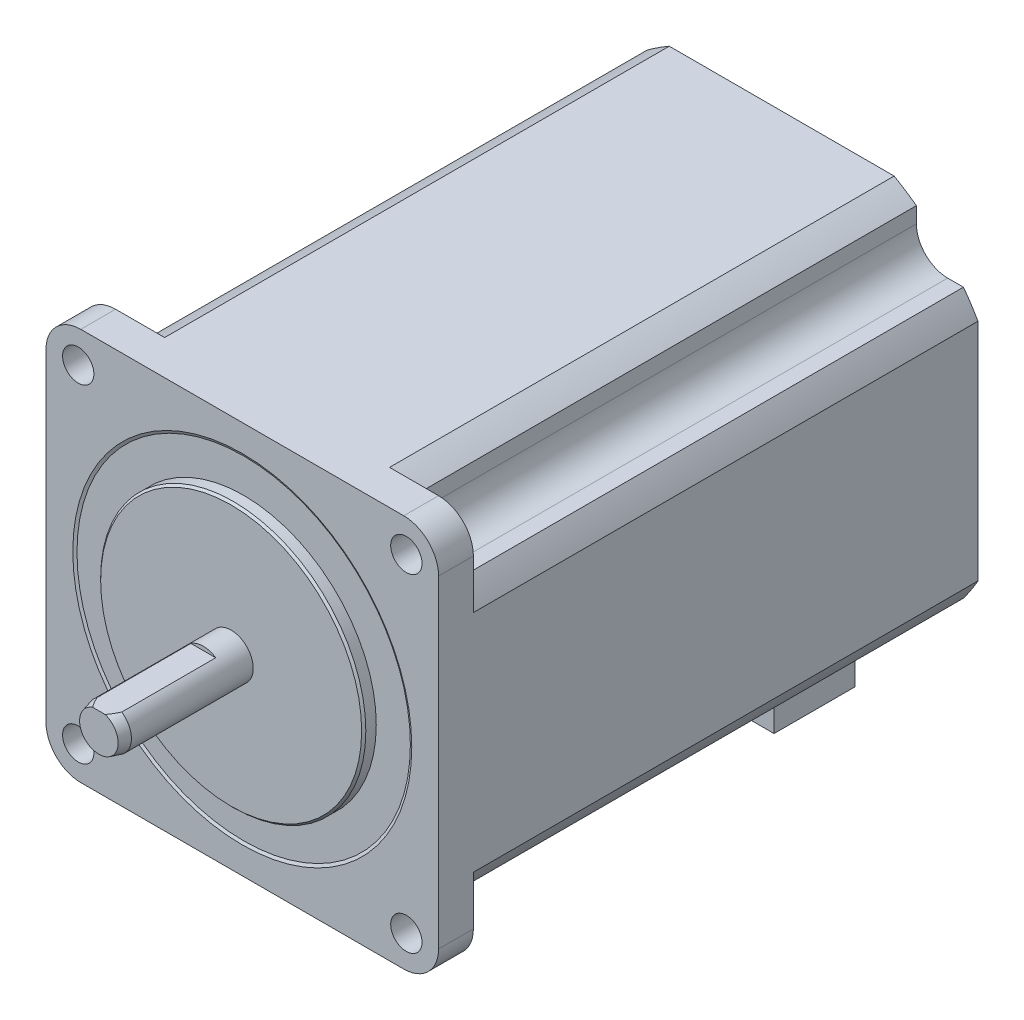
ISO-10303-21;
HEADER;
FILE_DESCRIPTION(('STEP AP214'),'2;1');
FILE_NAME('part.step','',(''),(''),'','','');
FILE_SCHEMA(('AUTOMOTIVE_DESIGN { 1 0 10303 214 1 1 1 1 }'));
ENDSEC;
DATA;
#1=APPLICATION_CONTEXT('core data for automotive mechanical design processes');
#2=APPLICATION_PROTOCOL_DEFINITION('international standard','automotive_design',2000,#1);
#3=PRODUCT_CONTEXT('',#1,'mechanical');
#4=PRODUCT('Part','Part','',(#3));
#5=PRODUCT_RELATED_PRODUCT_CATEGORY('part','',(#4));
#6=PRODUCT_DEFINITION_FORMATION('','',#4);
#7=PRODUCT_DEFINITION_CONTEXT('part definition',#1,'design');
#8=PRODUCT_DEFINITION('design','',#6,#7);
#9=PRODUCT_DEFINITION_SHAPE('','',#8);
#10=(LENGTH_UNIT() NAMED_UNIT(*) SI_UNIT(.MILLI.,.METRE.));
#11=(NAMED_UNIT(*) PLANE_ANGLE_UNIT() SI_UNIT($,.RADIAN.));
#12=(NAMED_UNIT(*) SI_UNIT($,.STERADIAN.) SOLID_ANGLE_UNIT());
#13=UNCERTAINTY_MEASURE_WITH_UNIT(LENGTH_MEASURE(1.E-05),#10,'distance_accuracy_value','');
#14=(GEOMETRIC_REPRESENTATION_CONTEXT(3) GLOBAL_UNCERTAINTY_ASSIGNED_CONTEXT((#13)) GLOBAL_UNIT_ASSIGNED_CONTEXT((#10,
#11,#12)) REPRESENTATION_CONTEXT('',''));
#15=CARTESIAN_POINT('',(0.,0.,0.));
#16=DIRECTION('',(0.,0.,1.));
#17=DIRECTION('',(1.,0.,0.));
#18=AXIS2_PLACEMENT_3D('',#15,#16,#17);
#19=CARTESIAN_POINT('',(0.,0.,19.));
#20=DIRECTION('',(0.,0.,-1.));
#21=DIRECTION('',(-1.,0.,0.));
#22=AXIS2_PLACEMENT_3D('',#19,#20,#21);
#23=CYLINDRICAL_SURFACE('',#22,3.175);
#24=CARTESIAN_POINT('',(0.,0.,17.4999999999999));
#25=DIRECTION('',(0.,0.,1.));
#26=DIRECTION('',(1.,0.,0.));
#27=AXIS2_PLACEMENT_3D('',#24,#25,#26);
#28=CIRCLE('',#27,3.175);
#29=CARTESIAN_POINT('',(1.78605710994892,2.625,17.5000000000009));
#30=VERTEX_POINT('',#29);
#31=CARTESIAN_POINT('',(-1.78605710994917,2.625,17.4999999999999));
#32=VERTEX_POINT('',#31);
#33=EDGE_CURVE('E310',#30,#32,#28,.F.);
#34=ORIENTED_EDGE('',*,*,#33,.T.);
#35=DIRECTION('',(0.,0.,-1.));
#36=VECTOR('',#35,1.);
#37=CARTESIAN_POINT('',(-1.78605710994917,2.625,19.));
#38=LINE('',#37,#36);
#39=CARTESIAN_POINT('',(-1.78605710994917,2.625,4.));
#40=VERTEX_POINT('',#39);
#41=EDGE_CURVE('E294',#32,#40,#38,.T.);
#42=ORIENTED_EDGE('',*,*,#41,.T.);
#43=CARTESIAN_POINT('',(0.,0.,4.));
#44=DIRECTION('',(0.,0.,1.));
#45=DIRECTION('',(1.,0.,0.));
#46=AXIS2_PLACEMENT_3D('',#43,#44,#45);
#47=CIRCLE('',#46,3.175);
#48=CARTESIAN_POINT('',(1.78605710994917,2.625,4.));
#49=VERTEX_POINT('',#48);
#50=EDGE_CURVE('E299',#49,#40,#47,.T.);
#51=ORIENTED_EDGE('',*,*,#50,.F.);
#52=DIRECTION('',(0.,0.,-1.));
#53=VECTOR('',#52,1.);
#54=CARTESIAN_POINT('',(1.78605710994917,2.625,19.));
#55=LINE('',#54,#53);
#56=EDGE_CURVE('E1236',#49,#30,#55,.F.);
#57=ORIENTED_EDGE('',*,*,#56,.T.);
#58=EDGE_LOOP('',(#34,#42,#51,#57));
#59=FACE_BOUND('',#58,.T.);
#60=CARTESIAN_POINT('',(0.,0.,0.));
#61=DIRECTION('',(0.,0.,-1.));
#62=DIRECTION('',(-1.,0.,0.));
#63=AXIS2_PLACEMENT_3D('',#60,#61,#62);
#64=CIRCLE('',#63,3.175);
#65=CARTESIAN_POINT('',(-3.175,0.,0.));
#66=VERTEX_POINT('',#65);
#67=EDGE_CURVE('E755',#66,#66,#64,.T.);
#68=ORIENTED_EDGE('',*,*,#67,.F.);
#69=EDGE_LOOP('',(#68));
#70=FACE_BOUND('',#69,.T.);
#71=ADVANCED_FACE('F39',(#59,#70),#23,.T.);
#72=CARTESIAN_POINT('',(0.,0.,19.));
#73=DIRECTION('',(0.,0.,1.));
#74=DIRECTION('',(1.,0.,0.));
#75=AXIS2_PLACEMENT_3D('',#72,#73,#74);
#76=PLANE('',#75);
#77=DIRECTION('',(1.,0.,0.));
#78=VECTOR('',#77,1.);
#79=CARTESIAN_POINT('',(-4.72781232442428,2.625,19.));
#80=LINE('',#79,#78);
#81=CARTESIAN_POINT('',(-0.894050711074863,2.625,19.));
#82=VERTEX_POINT('',#81);
#83=CARTESIAN_POINT('',(0.894050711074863,2.625,19.));
#84=VERTEX_POINT('',#83);
#85=EDGE_CURVE('E54',#82,#84,#80,.T.);
#86=ORIENTED_EDGE('',*,*,#85,.F.);
#87=CARTESIAN_POINT('',(0.,0.,19.));
#88=DIRECTION('',(0.,0.,1.));
#89=DIRECTION('',(1.,0.,0.));
#90=AXIS2_PLACEMENT_3D('',#87,#88,#89);
#91=CIRCLE('',#90,2.77307621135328);
#92=EDGE_CURVE('E305',#82,#84,#91,.T.);
#93=ORIENTED_EDGE('',*,*,#92,.T.);
#94=EDGE_LOOP('',(#86,#93));
#95=FACE_BOUND('',#94,.T.);
#96=ADVANCED_FACE('F304',(#95),#76,.T.);
#97=CARTESIAN_POINT('',(0.,0.,0.));
#98=DIRECTION('',(0.,0.,-1.));
#99=DIRECTION('',(-1.,0.,0.));
#100=AXIS2_PLACEMENT_3D('',#97,#98,#99);
#101=PLANE('',#100);
#102=CARTESIAN_POINT('',(0.,0.,0.));
#103=DIRECTION('',(0.,0.,-1.));
#104=DIRECTION('',(-1.,0.,0.));
#105=AXIS2_PLACEMENT_3D('',#102,#103,#104);
#106=CIRCLE('',#105,18.75);
#107=CARTESIAN_POINT('',(-18.75,0.,0.));
#108=VERTEX_POINT('',#107);
#109=EDGE_CURVE('E11',#108,#108,#106,.F.);
#110=ORIENTED_EDGE('',*,*,#109,.T.);
#111=EDGE_LOOP('',(#110));
#112=FACE_BOUND('',#111,.T.);
#113=ORIENTED_EDGE('',*,*,#67,.T.);
#114=EDGE_LOOP('',(#113));
#115=FACE_BOUND('',#114,.T.);
#116=ADVANCED_FACE('F445',(#112,#115),#101,.F.);
#117=CARTESIAN_POINT('',(0.,0.,-1.6));
#118=DIRECTION('',(0.,0.,1.));
#119=DIRECTION('',(1.,0.,0.));
#120=AXIS2_PLACEMENT_3D('',#117,#118,#119);
#121=CYLINDRICAL_SURFACE('',#120,19.05);
#122=CARTESIAN_POINT('',(0.,0.,-0.299999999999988));
#123=DIRECTION('',(0.,0.,-1.));
#124=DIRECTION('',(-1.,0.,0.));
#125=AXIS2_PLACEMENT_3D('',#122,#123,#124);
#126=CIRCLE('',#125,19.05);
#127=CARTESIAN_POINT('',(-19.05,0.,-0.299999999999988));
#128=VERTEX_POINT('',#127);
#129=EDGE_CURVE('E47',#128,#128,#126,.T.);
#130=ORIENTED_EDGE('',*,*,#129,.T.);
#131=EDGE_LOOP('',(#130));
#132=FACE_BOUND('',#131,.T.);
#133=CARTESIAN_POINT('',(0.,0.,-1.8));
#134=DIRECTION('',(0.,0.,1.));
#135=DIRECTION('',(1.,0.,0.));
#136=AXIS2_PLACEMENT_3D('',#133,#134,#135);
#137=CIRCLE('',#136,19.05);
#138=CARTESIAN_POINT('',(19.05,0.,-1.8));
#139=VERTEX_POINT('',#138);
#140=EDGE_CURVE('E1269',#139,#139,#137,.T.);
#141=ORIENTED_EDGE('',*,*,#140,.T.);
#142=EDGE_LOOP('',(#141));
#143=FACE_BOUND('',#142,.T.);
#144=ADVANCED_FACE('F448',(#132,#143),#121,.T.);
#145=CARTESIAN_POINT('',(0.,0.,19.));
#146=DIRECTION('',(0.,0.,-1.));
#147=DIRECTION('',(-1.,0.,0.));
#148=AXIS2_PLACEMENT_3D('',#145,#146,#147);
#149=CONICAL_SURFACE('',#148,2.77307621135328,0.261799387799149);
#150=CARTESIAN_POINT('',(-3.30935894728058,2.625,13.5849436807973));
#151=CARTESIAN_POINT('',(-3.24542473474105,2.625,13.7718399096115));
#152=CARTESIAN_POINT('',(-3.18087365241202,2.625,13.9585279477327));
#153=CARTESIAN_POINT('',(-3.05023975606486,2.625,14.331388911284));
#154=CARTESIAN_POINT('',(-2.98415678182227,2.625,14.5175617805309));
#155=CARTESIAN_POINT('',(-2.85014549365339,2.625,14.8893346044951));
#156=CARTESIAN_POINT('',(-2.78221639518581,2.625,15.0749342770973));
#157=CARTESIAN_POINT('',(-2.64413585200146,2.625,15.4452951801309));
#158=CARTESIAN_POINT('',(-2.57398453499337,2.625,15.6300564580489));
#159=CARTESIAN_POINT('',(-2.43088450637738,2.625,15.9985625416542));
#160=CARTESIAN_POINT('',(-2.35793492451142,2.625,16.1823070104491));
#161=CARTESIAN_POINT('',(-2.20847433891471,2.625,16.5483836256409));
#162=CARTESIAN_POINT('',(-2.13196278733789,2.625,16.7307155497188));
#163=CARTESIAN_POINT('',(-1.9741229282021,2.625,17.0936282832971));
#164=CARTESIAN_POINT('',(-1.89278731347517,2.625,17.2742059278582));
#165=CARTESIAN_POINT('',(-1.72367545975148,2.625,17.6322943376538));
#166=CARTESIAN_POINT('',(-1.63590163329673,2.625,17.8098062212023));
#167=CARTESIAN_POINT('',(-1.49689402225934,2.625,18.0727010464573));
#168=CARTESIAN_POINT('',(-1.44921905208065,2.625,18.1599613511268));
#169=CARTESIAN_POINT('',(-1.35081442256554,2.625,18.3328001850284));
#170=CARTESIAN_POINT('',(-1.30008362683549,2.625,18.4183780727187));
#171=CARTESIAN_POINT('',(-1.19492866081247,2.625,18.5868191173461));
#172=CARTESIAN_POINT('',(-1.14051856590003,2.625,18.669691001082));
#173=CARTESIAN_POINT('',(-1.02665023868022,2.625,18.8318604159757));
#174=CARTESIAN_POINT('',(-0.967196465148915,2.625,18.9111610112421));
#175=CARTESIAN_POINT('',(-0.86224269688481,2.625,19.0387203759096));
#176=CARTESIAN_POINT('',(-0.818661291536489,2.625,19.0885458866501));
#177=CARTESIAN_POINT('',(-0.72751356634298,2.625,19.1846578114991));
#178=CARTESIAN_POINT('',(-0.679939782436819,2.625,19.2309372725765));
#179=CARTESIAN_POINT('',(-0.579402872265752,2.625,19.3185048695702));
#180=CARTESIAN_POINT('',(-0.52638729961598,2.625,19.3597339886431));
#181=CARTESIAN_POINT('',(-0.41450792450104,2.625,19.4333493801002));
#182=CARTESIAN_POINT('',(-0.355665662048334,2.625,19.4657666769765));
#183=CARTESIAN_POINT('',(-0.254920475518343,2.625,19.5076037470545));
#184=CARTESIAN_POINT('',(-0.214733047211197,2.625,19.5210971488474));
#185=CARTESIAN_POINT('',(-0.132696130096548,2.625,19.5413023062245));
#186=CARTESIAN_POINT('',(-0.0908493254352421,2.625,19.5480245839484));
#187=CARTESIAN_POINT('',(-0.00641419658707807,2.625,19.5538691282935));
#188=CARTESIAN_POINT('',(0.036176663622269,2.625,19.5529560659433));
#189=CARTESIAN_POINT('',(0.120530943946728,2.625,19.5435732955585));
#190=CARTESIAN_POINT('',(0.162293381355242,2.625,19.5350951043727));
#191=CARTESIAN_POINT('',(0.254092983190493,2.625,19.5086701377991));
#192=CARTESIAN_POINT('',(0.303590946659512,2.625,19.4888870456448));
#193=CARTESIAN_POINT('',(0.398827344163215,2.625,19.4417789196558));
#194=CARTESIAN_POINT('',(0.444557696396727,2.625,19.4144381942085));
#195=CARTESIAN_POINT('',(0.528152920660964,2.625,19.3573624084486));
#196=CARTESIAN_POINT('',(0.56635190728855,2.625,19.3281050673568));
#197=CARTESIAN_POINT('',(0.640136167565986,2.625,19.2664333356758));
#198=CARTESIAN_POINT('',(0.675718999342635,2.625,19.2340160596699));
#199=CARTESIAN_POINT('',(0.744720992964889,2.625,19.1667643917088));
#200=CARTESIAN_POINT('',(0.778132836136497,2.625,19.1319225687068));
#201=CARTESIAN_POINT('',(0.842993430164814,2.625,19.0605004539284));
#202=CARTESIAN_POINT('',(0.874443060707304,2.625,19.0239209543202));
#203=CARTESIAN_POINT('',(0.960526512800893,2.625,18.9192141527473));
#204=CARTESIAN_POINT('',(1.01328788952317,2.625,18.8495504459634));
#205=CARTESIAN_POINT('',(1.11474355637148,2.625,18.7073019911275));
#206=CARTESIAN_POINT('',(1.16343498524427,2.625,18.6347152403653));
#207=CARTESIAN_POINT('',(1.25772470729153,2.625,18.4873519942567));
#208=CARTESIAN_POINT('',(1.30331615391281,2.625,18.4125711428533));
#209=CARTESIAN_POINT('',(1.3919413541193,2.625,18.2615031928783));
#210=CARTESIAN_POINT('',(1.4349746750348,2.625,18.1852158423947));
#211=CARTESIAN_POINT('',(1.56162993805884,2.625,17.953462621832));
#212=CARTESIAN_POINT('',(1.64208680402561,2.625,17.7962698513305));
#213=CARTESIAN_POINT('',(1.79705705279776,2.625,17.4792970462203));
#214=CARTESIAN_POINT('',(1.8715784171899,2.625,17.3195208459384));
#215=CARTESIAN_POINT('',(2.01054641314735,2.625,17.0108615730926));
#216=CARTESIAN_POINT('',(2.07532251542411,2.625,16.862126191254));
#217=CARTESIAN_POINT('',(2.20202359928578,2.625,16.5634427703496));
#218=CARTESIAN_POINT('',(2.26394842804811,2.625,16.4134946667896));
#219=CARTESIAN_POINT('',(2.44641955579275,2.625,15.9620477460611));
#220=CARTESIAN_POINT('',(2.56356197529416,2.625,15.6591749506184));
#221=CARTESIAN_POINT('',(2.78774888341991,2.625,15.0616544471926));
#222=CARTESIAN_POINT('',(2.89500244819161,2.625,14.7670842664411));
#223=CARTESIAN_POINT('',(3.0526461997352,2.625,14.3242983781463));
#224=CARTESIAN_POINT('',(3.10462177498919,2.625,14.1766447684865));
#225=CARTESIAN_POINT('',(3.20764960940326,2.625,13.8810202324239));
#226=CARTESIAN_POINT('',(3.25870189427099,2.625,13.7330493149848));
#227=CARTESIAN_POINT('',(3.30935894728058,2.625,13.5849436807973));
#228=B_SPLINE_CURVE_WITH_KNOTS('',3,(#150,#151,#152,#153,#154,#155,#156,#157,#158,#159,#160,
#161,#162,#163,#164,#165,#166,#167,#168,#169,#170,#171,#172,#173,#174,#175,#176,#177,#178,#179,
#180,#181,#182,#183,#184,#185,#186,#187,#188,#189,#190,#191,#192,#193,#194,#195,#196,#197,#198,
#199,#200,#201,#202,#203,#204,#205,#206,#207,#208,#209,#210,#211,#212,#213,#214,#215,#216,#217,
#218,#219,#220,#221,#222,#223,#224,#225,#226,#227),.UNSPECIFIED.,.F.,.F.,(4,2,2,2,2,2,2,2,2,2,2,
2,2,2,2,2,2,2,2,2,2,2,2,2,2,2,2,2,2,2,2,2,2,2,2,2,2,2,4),(0.,0.592590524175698,1.18524331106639,
1.77815202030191,2.37102671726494,2.96408731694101,3.55723943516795,4.15131417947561,
4.74516743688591,5.04342777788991,5.34179972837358,5.63908859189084,5.93611732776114,
6.13455567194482,6.33337364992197,6.53432931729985,6.73456801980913,6.86126706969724,
6.98776892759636,7.11485643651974,7.24208663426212,7.40110146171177,7.56044895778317,
7.70458491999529,7.84885375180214,7.99358608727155,8.13825306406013,8.4001916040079,
8.66231276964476,8.92499521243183,9.18772195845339,9.71727649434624,10.2461064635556,
10.7327538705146,11.219427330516,12.1935231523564,13.1339513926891,13.6035521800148,
14.0731398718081),.UNSPECIFIED.);
#229=EDGE_CURVE('E290',#32,#82,#228,.T.);
#230=ORIENTED_EDGE('',*,*,#229,.F.);
#231=ORIENTED_EDGE('',*,*,#33,.F.);
#232=EDGE_CURVE('E300',#84,#30,#228,.T.);
#233=ORIENTED_EDGE('',*,*,#232,.F.);
#234=ORIENTED_EDGE('',*,*,#92,.F.);
#235=EDGE_LOOP('',(#230,#231,#233,#234));
#236=FACE_BOUND('',#235,.T.);
#237=ADVANCED_FACE('F309',(#236),#149,.T.);
#238=CARTESIAN_POINT('',(0.,0.,4.));
#239=DIRECTION('',(0.,0.,1.));
#240=DIRECTION('',(1.,0.,0.));
#241=AXIS2_PLACEMENT_3D('',#238,#239,#240);
#242=PLANE('',#241);
#243=ORIENTED_EDGE('',*,*,#50,.T.);
#244=DIRECTION('',(1.,0.,0.));
#245=VECTOR('',#244,1.);
#246=CARTESIAN_POINT('',(-4.72781232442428,2.625,4.));
#247=LINE('',#246,#245);
#248=EDGE_CURVE('E306',#40,#49,#247,.T.);
#249=ORIENTED_EDGE('',*,*,#248,.T.);
#250=EDGE_LOOP('',(#243,#249));
#251=FACE_BOUND('',#250,.T.);
#252=ADVANCED_FACE('F331',(#251),#242,.T.);
#253=CARTESIAN_POINT('',(-4.72781232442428,2.625,4.));
#254=DIRECTION('',(0.,-1.,0.));
#255=DIRECTION('',(0.,0.,-1.));
#256=AXIS2_PLACEMENT_3D('',#253,#254,#255);
#257=PLANE('',#256);
#258=ORIENTED_EDGE('',*,*,#229,.T.);
#259=ORIENTED_EDGE('',*,*,#85,.T.);
#260=ORIENTED_EDGE('',*,*,#232,.T.);
#261=ORIENTED_EDGE('',*,*,#56,.F.);
#262=ORIENTED_EDGE('',*,*,#248,.F.);
#263=ORIENTED_EDGE('',*,*,#41,.F.);
#264=EDGE_LOOP('',(#258,#259,#260,#261,#262,#263));
#265=FACE_BOUND('',#264,.T.);
#266=ADVANCED_FACE('F291',(#265),#257,.F.);
#267=CARTESIAN_POINT('',(0.,0.,-1.8));
#268=DIRECTION('',(0.,0.,1.));
#269=DIRECTION('',(1.,0.,0.));
#270=AXIS2_PLACEMENT_3D('',#267,#268,#269);
#271=PLANE('',#270);
#272=CARTESIAN_POINT('',(0.,0.,-1.8));
#273=DIRECTION('',(0.,0.,1.));
#274=DIRECTION('',(1.,0.,0.));
#275=AXIS2_PLACEMENT_3D('',#272,#273,#274);
#276=CIRCLE('',#275,23.95);
#277=CARTESIAN_POINT('',(23.95,0.,-1.8));
#278=VERTEX_POINT('',#277);
#279=EDGE_CURVE('E1230',#278,#278,#276,.T.);
#280=ORIENTED_EDGE('',*,*,#279,.T.);
#281=EDGE_LOOP('',(#280));
#282=FACE_BOUND('',#281,.T.);
#283=ORIENTED_EDGE('',*,*,#140,.F.);
#284=EDGE_LOOP('',(#283));
#285=FACE_BOUND('',#284,.T.);
#286=ADVANCED_FACE('F330',(#282,#285),#271,.T.);
#287=CARTESIAN_POINT('',(0.,-19.35,-79.1));
#288=DIRECTION('',(0.,1.,0.));
#289=DIRECTION('',(-1.,0.,0.));
#290=AXIS2_PLACEMENT_3D('',#287,#288,#289);
#291=PLANE('',#290);
#292=DIRECTION('',(-1.,0.,0.));
#293=VECTOR('',#292,1.);
#294=CARTESIAN_POINT('',(0.,-19.35,-79.1));
#295=LINE('',#294,#293);
#296=CARTESIAN_POINT('',(-23.85,-19.35,-79.1));
#297=VERTEX_POINT('',#296);
#298=CARTESIAN_POINT('',(-26.1118268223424,-19.35,-79.1));
#299=VERTEX_POINT('',#298);
#300=EDGE_CURVE('E523',#297,#299,#295,.T.);
#301=ORIENTED_EDGE('',*,*,#300,.F.);
#302=DIRECTION('',(0.,0.,1.));
#303=VECTOR('',#302,1.);
#304=CARTESIAN_POINT('',(-23.85,-19.35,-79.1));
#305=LINE('',#304,#303);
#306=CARTESIAN_POINT('',(-23.85,-19.35,-6.6));
#307=VERTEX_POINT('',#306);
#308=EDGE_CURVE('E592',#297,#307,#305,.T.);
#309=ORIENTED_EDGE('',*,*,#308,.T.);
#310=DIRECTION('',(-1.,0.,0.));
#311=VECTOR('',#310,1.);
#312=CARTESIAN_POINT('',(0.,-19.35,-6.6));
#313=LINE('',#312,#311);
#314=CARTESIAN_POINT('',(-26.1118268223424,-19.35,-6.6));
#315=VERTEX_POINT('',#314);
#316=EDGE_CURVE('E675',#307,#315,#313,.T.);
#317=ORIENTED_EDGE('',*,*,#316,.T.);
#318=DIRECTION('',(0.,0.,1.));
#319=VECTOR('',#318,1.);
#320=CARTESIAN_POINT('',(-26.1118268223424,-19.35,-79.1));
#321=LINE('',#320,#319);
#322=EDGE_CURVE('E677',#299,#315,#321,.T.);
#323=ORIENTED_EDGE('',*,*,#322,.F.);
#324=EDGE_LOOP('',(#301,#309,#317,#323));
#325=FACE_BOUND('',#324,.T.);
#326=ADVANCED_FACE('F363',(#325),#291,.F.);
#327=CARTESIAN_POINT('',(-23.85,-23.85,-79.1));
#328=DIRECTION('',(0.,0.,1.));
#329=DIRECTION('',(1.,0.,0.));
#330=AXIS2_PLACEMENT_3D('',#327,#328,#329);
#331=CYLINDRICAL_SURFACE('',#330,4.5);
#332=CARTESIAN_POINT('',(-23.85,-23.85,-79.1));
#333=DIRECTION('',(0.,0.,-1.));
#334=DIRECTION('',(-1.,0.,0.));
#335=AXIS2_PLACEMENT_3D('',#332,#333,#334);
#336=CIRCLE('',#335,4.5);
#337=CARTESIAN_POINT('',(-19.35,-23.85,-79.1));
#338=VERTEX_POINT('',#337);
#339=EDGE_CURVE('E612',#338,#297,#336,.F.);
#340=ORIENTED_EDGE('',*,*,#339,.F.);
#341=DIRECTION('',(0.,0.,1.));
#342=VECTOR('',#341,1.);
#343=CARTESIAN_POINT('',(-19.35,-23.85,-79.1));
#344=LINE('',#343,#342);
#345=CARTESIAN_POINT('',(-19.35,-23.85,-6.6));
#346=VERTEX_POINT('',#345);
#347=EDGE_CURVE('E597',#346,#338,#344,.F.);
#348=ORIENTED_EDGE('',*,*,#347,.F.);
#349=CARTESIAN_POINT('',(-23.85,-23.85,-6.59999999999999));
#350=DIRECTION('',(0.,0.,-1.));
#351=DIRECTION('',(-1.,0.,0.));
#352=AXIS2_PLACEMENT_3D('',#349,#350,#351);
#353=CIRCLE('',#352,4.5);
#354=EDGE_CURVE('E595',#307,#346,#353,.T.);
#355=ORIENTED_EDGE('',*,*,#354,.F.);
#356=ORIENTED_EDGE('',*,*,#308,.F.);
#357=EDGE_LOOP('',(#340,#348,#355,#356));
#358=FACE_BOUND('',#357,.T.);
#359=ADVANCED_FACE('F366',(#358),#331,.F.);
#360=CARTESIAN_POINT('',(-19.35,0.,-79.1));
#361=DIRECTION('',(-1.,0.,0.));
#362=DIRECTION('',(0.,-1.,0.));
#363=AXIS2_PLACEMENT_3D('',#360,#361,#362);
#364=PLANE('',#363);
#365=DIRECTION('',(0.,-1.,0.));
#366=VECTOR('',#365,1.);
#367=CARTESIAN_POINT('',(-19.35,0.,-6.6));
#368=LINE('',#367,#366);
#369=CARTESIAN_POINT('',(-19.35,-26.1118268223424,-6.6));
#370=VERTEX_POINT('',#369);
#371=EDGE_CURVE('E673',#346,#370,#368,.T.);
#372=ORIENTED_EDGE('',*,*,#371,.F.);
#373=ORIENTED_EDGE('',*,*,#347,.T.);
#374=DIRECTION('',(0.,-1.,0.));
#375=VECTOR('',#374,1.);
#376=CARTESIAN_POINT('',(-19.35,0.,-79.1));
#377=LINE('',#376,#375);
#378=CARTESIAN_POINT('',(-19.35,-26.1118268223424,-79.1));
#379=VERTEX_POINT('',#378);
#380=EDGE_CURVE('E521',#338,#379,#377,.T.);
#381=ORIENTED_EDGE('',*,*,#380,.T.);
#382=DIRECTION('',(0.,0.,1.));
#383=VECTOR('',#382,1.);
#384=CARTESIAN_POINT('',(-19.35,-26.1118268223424,-79.1));
#385=LINE('',#384,#383);
#386=EDGE_CURVE('E680',#379,#370,#385,.T.);
#387=ORIENTED_EDGE('',*,*,#386,.T.);
#388=EDGE_LOOP('',(#372,#373,#381,#387));
#389=FACE_BOUND('',#388,.T.);
#390=ADVANCED_FACE('F368',(#389),#364,.T.);
#391=CARTESIAN_POINT('',(-19.35,0.,-79.1));
#392=DIRECTION('',(-1.,0.,0.));
#393=DIRECTION('',(0.,0.,1.));
#394=AXIS2_PLACEMENT_3D('',#391,#392,#393);
#395=PLANE('',#394);
#396=DIRECTION('',(0.,-1.,0.));
#397=VECTOR('',#396,1.);
#398=CARTESIAN_POINT('',(-19.35,0.,-79.1));
#399=LINE('',#398,#397);
#400=CARTESIAN_POINT('',(-19.35,26.1118268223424,-79.1));
#401=VERTEX_POINT('',#400);
#402=CARTESIAN_POINT('',(-19.35,23.85,-79.1));
#403=VERTEX_POINT('',#402);
#404=EDGE_CURVE('E617',#401,#403,#399,.T.);
#405=ORIENTED_EDGE('',*,*,#404,.T.);
#406=DIRECTION('',(0.,0.,1.));
#407=VECTOR('',#406,1.);
#408=CARTESIAN_POINT('',(-19.35,23.85,-6.59999999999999));
#409=LINE('',#408,#407);
#410=CARTESIAN_POINT('',(-19.35,23.85,-6.6));
#411=VERTEX_POINT('',#410);
#412=EDGE_CURVE('E599',#403,#411,#409,.T.);
#413=ORIENTED_EDGE('',*,*,#412,.T.);
#414=DIRECTION('',(0.,-1.,0.));
#415=VECTOR('',#414,1.);
#416=CARTESIAN_POINT('',(-19.35,0.,-6.6));
#417=LINE('',#416,#415);
#418=CARTESIAN_POINT('',(-19.35,26.1118268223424,-6.6));
#419=VERTEX_POINT('',#418);
#420=EDGE_CURVE('E578',#419,#411,#417,.T.);
#421=ORIENTED_EDGE('',*,*,#420,.F.);
#422=DIRECTION('',(0.,0.,1.));
#423=VECTOR('',#422,1.);
#424=CARTESIAN_POINT('',(-19.35,26.1118268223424,-79.1));
#425=LINE('',#424,#423);
#426=EDGE_CURVE('E581',#401,#419,#425,.T.);
#427=ORIENTED_EDGE('',*,*,#426,.F.);
#428=EDGE_LOOP('',(#405,#413,#421,#427));
#429=FACE_BOUND('',#428,.T.);
#430=ADVANCED_FACE('F371',(#429),#395,.T.);
#431=CARTESIAN_POINT('',(-23.85,23.85,-79.1));
#432=DIRECTION('',(0.,0.,-1.));
#433=DIRECTION('',(-1.,0.,0.));
#434=AXIS2_PLACEMENT_3D('',#431,#432,#433);
#435=CYLINDRICAL_SURFACE('',#434,4.5);
#436=CARTESIAN_POINT('',(-23.85,23.85,-79.1));
#437=DIRECTION('',(0.,0.,-1.));
#438=DIRECTION('',(-1.,0.,0.));
#439=AXIS2_PLACEMENT_3D('',#436,#437,#438);
#440=CIRCLE('',#439,4.5);
#441=CARTESIAN_POINT('',(-23.85,19.35,-79.1));
#442=VERTEX_POINT('',#441);
#443=EDGE_CURVE('E314',#442,#403,#440,.F.);
#444=ORIENTED_EDGE('',*,*,#443,.F.);
#445=DIRECTION('',(0.,0.,1.));
#446=VECTOR('',#445,1.);
#447=CARTESIAN_POINT('',(-23.85,19.35,-79.1));
#448=LINE('',#447,#446);
#449=CARTESIAN_POINT('',(-23.85,19.35,-6.6));
#450=VERTEX_POINT('',#449);
#451=EDGE_CURVE('E604',#450,#442,#448,.F.);
#452=ORIENTED_EDGE('',*,*,#451,.F.);
#453=CARTESIAN_POINT('',(-23.85,23.85,-6.59999999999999));
#454=DIRECTION('',(0.,0.,-1.));
#455=DIRECTION('',(-1.,0.,0.));
#456=AXIS2_PLACEMENT_3D('',#453,#454,#455);
#457=CIRCLE('',#456,4.5);
#458=EDGE_CURVE('E602',#411,#450,#457,.T.);
#459=ORIENTED_EDGE('',*,*,#458,.F.);
#460=ORIENTED_EDGE('',*,*,#412,.F.);
#461=EDGE_LOOP('',(#444,#452,#459,#460));
#462=FACE_BOUND('',#461,.T.);
#463=ADVANCED_FACE('F391',(#462),#435,.F.);
#464=CARTESIAN_POINT('',(0.,19.3500000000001,-79.1));
#465=DIRECTION('',(0.,1.,0.));
#466=DIRECTION('',(-1.,0.,0.));
#467=AXIS2_PLACEMENT_3D('',#464,#465,#466);
#468=PLANE('',#467);
#469=DIRECTION('',(-1.,0.,0.));
#470=VECTOR('',#469,1.);
#471=CARTESIAN_POINT('',(0.,19.3500000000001,-6.6));
#472=LINE('',#471,#470);
#473=CARTESIAN_POINT('',(-26.1118268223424,19.35,-6.6));
#474=VERTEX_POINT('',#473);
#475=EDGE_CURVE('E528',#450,#474,#472,.T.);
#476=ORIENTED_EDGE('',*,*,#475,.F.);
#477=ORIENTED_EDGE('',*,*,#451,.T.);
#478=DIRECTION('',(-1.,0.,0.));
#479=VECTOR('',#478,1.);
#480=CARTESIAN_POINT('',(0.,19.3500000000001,-79.1));
#481=LINE('',#480,#479);
#482=CARTESIAN_POINT('',(-26.1118268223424,19.35,-79.1));
#483=VERTEX_POINT('',#482);
#484=EDGE_CURVE('E619',#442,#483,#481,.T.);
#485=ORIENTED_EDGE('',*,*,#484,.T.);
#486=DIRECTION('',(0.,0.,1.));
#487=VECTOR('',#486,1.);
#488=CARTESIAN_POINT('',(-26.1118268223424,19.35,-79.1));
#489=LINE('',#488,#487);
#490=EDGE_CURVE('E632',#483,#474,#489,.T.);
#491=ORIENTED_EDGE('',*,*,#490,.T.);
#492=EDGE_LOOP('',(#476,#477,#485,#491));
#493=FACE_BOUND('',#492,.T.);
#494=ADVANCED_FACE('F337',(#493),#468,.T.);
#495=CARTESIAN_POINT('',(0.,-38.2,0.));
#496=DIRECTION('',(0.,1.,0.));
#497=DIRECTION('',(0.,0.,1.));
#498=AXIS2_PLACEMENT_3D('',#495,#496,#497);
#499=PLANE('',#498);
#500=DIRECTION('',(0.,0.,-1.));
#501=VECTOR('',#500,1.);
#502=CARTESIAN_POINT('',(-10.5,-38.2,-79.1));
#503=LINE('',#502,#501);
#504=CARTESIAN_POINT('',(-10.5,-38.2,-67.5));
#505=VERTEX_POINT('',#504);
#506=CARTESIAN_POINT('',(-10.5,-38.2,-79.1));
#507=VERTEX_POINT('',#506);
#508=EDGE_CURVE('E1244',#505,#507,#503,.T.);
#509=ORIENTED_EDGE('',*,*,#508,.T.);
#510=DIRECTION('',(1.,0.,0.));
#511=VECTOR('',#510,1.);
#512=CARTESIAN_POINT('',(-10.5,-38.2,-79.1));
#513=LINE('',#512,#511);
#514=CARTESIAN_POINT('',(10.5,-38.2,-79.1));
#515=VERTEX_POINT('',#514);
#516=EDGE_CURVE('E1247',#507,#515,#513,.T.);
#517=ORIENTED_EDGE('',*,*,#516,.T.);
#518=DIRECTION('',(0.,0.,1.));
#519=VECTOR('',#518,1.);
#520=CARTESIAN_POINT('',(10.5,-38.2,-79.1));
#521=LINE('',#520,#519);
#522=CARTESIAN_POINT('',(10.5,-38.2,-67.5));
#523=VERTEX_POINT('',#522);
#524=EDGE_CURVE('E1250',#515,#523,#521,.T.);
#525=ORIENTED_EDGE('',*,*,#524,.T.);
#526=DIRECTION('',(-1.,0.,0.));
#527=VECTOR('',#526,1.);
#528=CARTESIAN_POINT('',(-10.5,-38.2,-67.5));
#529=LINE('',#528,#527);
#530=EDGE_CURVE('E1252',#523,#505,#529,.T.);
#531=ORIENTED_EDGE('',*,*,#530,.T.);
#532=EDGE_LOOP('',(#509,#517,#525,#531));
#533=FACE_BOUND('',#532,.T.);
#534=ADVANCED_FACE('F333',(#533),#499,.F.);
#535=CARTESIAN_POINT('',(19.35,0.,-79.1));
#536=DIRECTION('',(-1.,0.,0.));
#537=DIRECTION('',(0.,-1.,0.));
#538=AXIS2_PLACEMENT_3D('',#535,#536,#537);
#539=PLANE('',#538);
#540=DIRECTION('',(0.,-1.,0.));
#541=VECTOR('',#540,1.);
#542=CARTESIAN_POINT('',(19.35,0.,-6.6));
#543=LINE('',#542,#541);
#544=CARTESIAN_POINT('',(19.35,26.1118268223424,-6.6));
#545=VERTEX_POINT('',#544);
#546=CARTESIAN_POINT('',(19.35,23.85,-6.6));
#547=VERTEX_POINT('',#546);
#548=EDGE_CURVE('E567',#545,#547,#543,.T.);
#549=ORIENTED_EDGE('',*,*,#548,.T.);
#550=DIRECTION('',(0.,0.,1.));
#551=VECTOR('',#550,1.);
#552=CARTESIAN_POINT('',(19.35,23.85,-79.1));
#553=LINE('',#552,#551);
#554=CARTESIAN_POINT('',(19.35,23.85,-79.1));
#555=VERTEX_POINT('',#554);
#556=EDGE_CURVE('E485',#547,#555,#553,.F.);
#557=ORIENTED_EDGE('',*,*,#556,.T.);
#558=DIRECTION('',(0.,-1.,0.));
#559=VECTOR('',#558,1.);
#560=CARTESIAN_POINT('',(19.35,0.,-79.1));
#561=LINE('',#560,#559);
#562=CARTESIAN_POINT('',(19.35,26.1118268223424,-79.1));
#563=VERTEX_POINT('',#562);
#564=EDGE_CURVE('E494',#563,#555,#561,.T.);
#565=ORIENTED_EDGE('',*,*,#564,.F.);
#566=DIRECTION('',(0.,0.,1.));
#567=VECTOR('',#566,1.);
#568=CARTESIAN_POINT('',(19.35,26.1118268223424,-79.1));
#569=LINE('',#568,#567);
#570=EDGE_CURVE('E574',#563,#545,#569,.T.);
#571=ORIENTED_EDGE('',*,*,#570,.T.);
#572=EDGE_LOOP('',(#549,#557,#565,#571));
#573=FACE_BOUND('',#572,.T.);
#574=ADVANCED_FACE('F336',(#573),#539,.F.);
#575=CARTESIAN_POINT('',(23.85,23.85,-79.1));
#576=DIRECTION('',(0.,0.,1.));
#577=DIRECTION('',(1.,0.,0.));
#578=AXIS2_PLACEMENT_3D('',#575,#576,#577);
#579=CYLINDRICAL_SURFACE('',#578,4.5);
#580=CARTESIAN_POINT('',(23.85,23.85,-79.1));
#581=DIRECTION('',(0.,0.,-1.));
#582=DIRECTION('',(-1.,0.,0.));
#583=AXIS2_PLACEMENT_3D('',#580,#581,#582);
#584=CIRCLE('',#583,4.5);
#585=CARTESIAN_POINT('',(23.85,19.35,-79.1));
#586=VERTEX_POINT('',#585);
#587=EDGE_CURVE('E311',#555,#586,#584,.F.);
#588=ORIENTED_EDGE('',*,*,#587,.F.);
#589=ORIENTED_EDGE('',*,*,#556,.F.);
#590=CARTESIAN_POINT('',(23.85,23.85,-6.59999999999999));
#591=DIRECTION('',(0.,0.,-1.));
#592=DIRECTION('',(-1.,0.,0.));
#593=AXIS2_PLACEMENT_3D('',#590,#591,#592);
#594=CIRCLE('',#593,4.5);
#595=CARTESIAN_POINT('',(23.85,19.35,-6.6));
#596=VERTEX_POINT('',#595);
#597=EDGE_CURVE('E607',#596,#547,#594,.T.);
#598=ORIENTED_EDGE('',*,*,#597,.F.);
#599=DIRECTION('',(0.,0.,1.));
#600=VECTOR('',#599,1.);
#601=CARTESIAN_POINT('',(23.85,19.35,-79.1));
#602=LINE('',#601,#600);
#603=EDGE_CURVE('E487',#586,#596,#602,.T.);
#604=ORIENTED_EDGE('',*,*,#603,.F.);
#605=EDGE_LOOP('',(#588,#589,#598,#604));
#606=FACE_BOUND('',#605,.T.);
#607=ADVANCED_FACE('F384',(#606),#579,.F.);
#608=CARTESIAN_POINT('',(0.,19.3500000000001,-79.1));
#609=DIRECTION('',(0.,1.,0.));
#610=DIRECTION('',(-1.,0.,0.));
#611=AXIS2_PLACEMENT_3D('',#608,#609,#610);
#612=PLANE('',#611);
#613=DIRECTION('',(-1.,0.,0.));
#614=VECTOR('',#613,1.);
#615=CARTESIAN_POINT('',(0.,19.3500000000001,-79.1));
#616=LINE('',#615,#614);
#617=CARTESIAN_POINT('',(26.1118268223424,19.35,-79.1));
#618=VERTEX_POINT('',#617);
#619=EDGE_CURVE('E492',#618,#586,#616,.T.);
#620=ORIENTED_EDGE('',*,*,#619,.T.);
#621=ORIENTED_EDGE('',*,*,#603,.T.);
#622=DIRECTION('',(-1.,0.,0.));
#623=VECTOR('',#622,1.);
#624=CARTESIAN_POINT('',(0.,19.3500000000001,-6.6));
#625=LINE('',#624,#623);
#626=CARTESIAN_POINT('',(26.1118268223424,19.35,-6.6));
#627=VERTEX_POINT('',#626);
#628=EDGE_CURVE('E664',#627,#596,#625,.T.);
#629=ORIENTED_EDGE('',*,*,#628,.F.);
#630=DIRECTION('',(0.,0.,1.));
#631=VECTOR('',#630,1.);
#632=CARTESIAN_POINT('',(26.1118268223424,19.35,-79.1));
#633=LINE('',#632,#631);
#634=EDGE_CURVE('E498',#618,#627,#633,.T.);
#635=ORIENTED_EDGE('',*,*,#634,.F.);
#636=EDGE_LOOP('',(#620,#621,#629,#635));
#637=FACE_BOUND('',#636,.T.);
#638=ADVANCED_FACE('F380',(#637),#612,.T.);
#639=CARTESIAN_POINT('',(0.,-19.3499999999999,-79.1));
#640=DIRECTION('',(0.,1.,0.));
#641=DIRECTION('',(-1.,0.,0.));
#642=AXIS2_PLACEMENT_3D('',#639,#640,#641);
#643=PLANE('',#642);
#644=DIRECTION('',(-1.,0.,0.));
#645=VECTOR('',#644,1.);
#646=CARTESIAN_POINT('',(0.,-19.3499999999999,-6.6));
#647=LINE('',#646,#645);
#648=CARTESIAN_POINT('',(26.1118268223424,-19.35,-6.6));
#649=VERTEX_POINT('',#648);
#650=CARTESIAN_POINT('',(23.85,-19.35,-6.6));
#651=VERTEX_POINT('',#650);
#652=EDGE_CURVE('E668',#649,#651,#647,.T.);
#653=ORIENTED_EDGE('',*,*,#652,.T.);
#654=DIRECTION('',(0.,0.,1.));
#655=VECTOR('',#654,1.);
#656=CARTESIAN_POINT('',(23.85,-19.35,-79.1));
#657=LINE('',#656,#655);
#658=CARTESIAN_POINT('',(23.85,-19.35,-79.1));
#659=VERTEX_POINT('',#658);
#660=EDGE_CURVE('E590',#651,#659,#657,.F.);
#661=ORIENTED_EDGE('',*,*,#660,.T.);
#662=DIRECTION('',(-1.,0.,0.));
#663=VECTOR('',#662,1.);
#664=CARTESIAN_POINT('',(0.,-19.3499999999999,-79.1));
#665=LINE('',#664,#663);
#666=CARTESIAN_POINT('',(26.1118268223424,-19.35,-79.1));
#667=VERTEX_POINT('',#666);
#668=EDGE_CURVE('E510',#667,#659,#665,.T.);
#669=ORIENTED_EDGE('',*,*,#668,.F.);
#670=DIRECTION('',(0.,0.,1.));
#671=VECTOR('',#670,1.);
#672=CARTESIAN_POINT('',(26.1118268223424,-19.35,-79.1));
#673=LINE('',#672,#671);
#674=EDGE_CURVE('E688',#667,#649,#673,.T.);
#675=ORIENTED_EDGE('',*,*,#674,.T.);
#676=EDGE_LOOP('',(#653,#661,#669,#675));
#677=FACE_BOUND('',#676,.T.);
#678=ADVANCED_FACE('F377',(#677),#643,.F.);
#679=CARTESIAN_POINT('',(23.85,-23.85,-79.1));
#680=DIRECTION('',(0.,0.,-1.));
#681=DIRECTION('',(-1.,0.,0.));
#682=AXIS2_PLACEMENT_3D('',#679,#680,#681);
#683=CYLINDRICAL_SURFACE('',#682,4.5);
#684=CARTESIAN_POINT('',(23.85,-23.85,-79.1));
#685=DIRECTION('',(0.,0.,-1.));
#686=DIRECTION('',(-1.,0.,0.));
#687=AXIS2_PLACEMENT_3D('',#684,#685,#686);
#688=CIRCLE('',#687,4.5);
#689=CARTESIAN_POINT('',(19.35,-23.85,-79.1));
#690=VERTEX_POINT('',#689);
#691=EDGE_CURVE('E610',#659,#690,#688,.F.);
#692=ORIENTED_EDGE('',*,*,#691,.F.);
#693=ORIENTED_EDGE('',*,*,#660,.F.);
#694=CARTESIAN_POINT('',(23.85,-23.85,-6.59999999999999));
#695=DIRECTION('',(0.,0.,-1.));
#696=DIRECTION('',(-1.,0.,0.));
#697=AXIS2_PLACEMENT_3D('',#694,#695,#696);
#698=CIRCLE('',#697,4.5);
#699=CARTESIAN_POINT('',(19.35,-23.85,-6.6));
#700=VERTEX_POINT('',#699);
#701=EDGE_CURVE('E587',#700,#651,#698,.T.);
#702=ORIENTED_EDGE('',*,*,#701,.F.);
#703=DIRECTION('',(0.,0.,1.));
#704=VECTOR('',#703,1.);
#705=CARTESIAN_POINT('',(19.35,-23.85,-6.59999999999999));
#706=LINE('',#705,#704);
#707=EDGE_CURVE('E584',#690,#700,#706,.T.);
#708=ORIENTED_EDGE('',*,*,#707,.F.);
#709=EDGE_LOOP('',(#692,#693,#702,#708));
#710=FACE_BOUND('',#709,.T.);
#711=ADVANCED_FACE('F375',(#710),#683,.F.);
#712=CARTESIAN_POINT('',(19.35,0.,-79.1));
#713=DIRECTION('',(-1.,0.,0.));
#714=DIRECTION('',(0.,-1.,0.));
#715=AXIS2_PLACEMENT_3D('',#712,#713,#714);
#716=PLANE('',#715);
#717=DIRECTION('',(0.,-1.,0.));
#718=VECTOR('',#717,1.);
#719=CARTESIAN_POINT('',(19.35,0.,-79.1));
#720=LINE('',#719,#718);
#721=CARTESIAN_POINT('',(19.35,-26.1118268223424,-79.1));
#722=VERTEX_POINT('',#721);
#723=EDGE_CURVE('E513',#690,#722,#720,.T.);
#724=ORIENTED_EDGE('',*,*,#723,.F.);
#725=ORIENTED_EDGE('',*,*,#707,.T.);
#726=DIRECTION('',(0.,-1.,0.));
#727=VECTOR('',#726,1.);
#728=CARTESIAN_POINT('',(19.35,0.,-6.6));
#729=LINE('',#728,#727);
#730=CARTESIAN_POINT('',(19.35,-26.1118268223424,-6.6));
#731=VERTEX_POINT('',#730);
#732=EDGE_CURVE('E671',#700,#731,#729,.T.);
#733=ORIENTED_EDGE('',*,*,#732,.T.);
#734=DIRECTION('',(0.,0.,1.));
#735=VECTOR('',#734,1.);
#736=CARTESIAN_POINT('',(19.35,-26.1118268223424,-79.1));
#737=LINE('',#736,#735);
#738=EDGE_CURVE('E685',#722,#731,#737,.T.);
#739=ORIENTED_EDGE('',*,*,#738,.F.);
#740=EDGE_LOOP('',(#724,#725,#733,#739));
#741=FACE_BOUND('',#740,.T.);
#742=ADVANCED_FACE('F360',(#741),#716,.F.);
#743=CARTESIAN_POINT('',(0.,0.,-79.1));
#744=DIRECTION('',(0.,0.,1.));
#745=DIRECTION('',(1.,0.,0.));
#746=AXIS2_PLACEMENT_3D('',#743,#744,#745);
#747=CYLINDRICAL_SURFACE('',#746,32.5);
#748=CARTESIAN_POINT('',(0.,0.,-6.6));
#749=DIRECTION('',(0.,0.,-1.));
#750=DIRECTION('',(-1.,0.,0.));
#751=AXIS2_PLACEMENT_3D('',#748,#749,#750);
#752=CIRCLE('',#751,32.5);
#753=CARTESIAN_POINT('',(-28.2,-16.1558039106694,-6.6));
#754=VERTEX_POINT('',#753);
#755=EDGE_CURVE('E533',#315,#754,#752,.T.);
#756=ORIENTED_EDGE('',*,*,#755,.T.);
#757=DIRECTION('',(0.,0.,1.));
#758=VECTOR('',#757,1.);
#759=CARTESIAN_POINT('',(-28.2,-16.1558039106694,-79.1));
#760=LINE('',#759,#758);
#761=CARTESIAN_POINT('',(-28.2,-16.1558039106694,-79.1));
#762=VERTEX_POINT('',#761);
#763=EDGE_CURVE('E681',#762,#754,#760,.T.);
#764=ORIENTED_EDGE('',*,*,#763,.F.);
#765=CARTESIAN_POINT('',(0.,0.,-79.1));
#766=DIRECTION('',(0.,0.,-1.));
#767=DIRECTION('',(-1.,0.,0.));
#768=AXIS2_PLACEMENT_3D('',#765,#766,#767);
#769=CIRCLE('',#768,32.5);
#770=EDGE_CURVE('E525',#299,#762,#769,.T.);
#771=ORIENTED_EDGE('',*,*,#770,.F.);
#772=ORIENTED_EDGE('',*,*,#322,.T.);
#773=EDGE_LOOP('',(#756,#764,#771,#772));
#774=FACE_BOUND('',#773,.T.);
#775=ADVANCED_FACE('F356',(#774),#747,.T.);
#776=CARTESIAN_POINT('',(-28.2,16.1558039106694,-6.6));
#777=VERTEX_POINT('',#776);
#778=EDGE_CURVE('E540',#777,#474,#752,.T.);
#779=ORIENTED_EDGE('',*,*,#778,.T.);
#780=ORIENTED_EDGE('',*,*,#490,.F.);
#781=CARTESIAN_POINT('',(-28.2,16.1558039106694,-79.1));
#782=VERTEX_POINT('',#781);
#783=EDGE_CURVE('E645',#782,#483,#769,.T.);
#784=ORIENTED_EDGE('',*,*,#783,.F.);
#785=DIRECTION('',(0.,0.,1.));
#786=VECTOR('',#785,1.);
#787=CARTESIAN_POINT('',(-28.2,16.1558039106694,-79.1));
#788=LINE('',#787,#786);
#789=EDGE_CURVE('E697',#782,#777,#788,.T.);
#790=ORIENTED_EDGE('',*,*,#789,.T.);
#791=EDGE_LOOP('',(#779,#780,#784,#790));
#792=FACE_BOUND('',#791,.T.);
#793=ADVANCED_FACE('F359',(#792),#747,.T.);
#794=CARTESIAN_POINT('',(-16.1558039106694,28.2,-6.6));
#795=VERTEX_POINT('',#794);
#796=EDGE_CURVE('E568',#419,#795,#752,.T.);
#797=ORIENTED_EDGE('',*,*,#796,.T.);
#798=DIRECTION('',(0.,0.,1.));
#799=VECTOR('',#798,1.);
#800=CARTESIAN_POINT('',(-16.1558039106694,28.2,-79.1));
#801=LINE('',#800,#799);
#802=CARTESIAN_POINT('',(-16.1558039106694,28.2,-79.1));
#803=VERTEX_POINT('',#802);
#804=EDGE_CURVE('E573',#803,#795,#801,.T.);
#805=ORIENTED_EDGE('',*,*,#804,.F.);
#806=EDGE_CURVE('E626',#401,#803,#769,.T.);
#807=ORIENTED_EDGE('',*,*,#806,.F.);
#808=ORIENTED_EDGE('',*,*,#426,.T.);
#809=EDGE_LOOP('',(#797,#805,#807,#808));
#810=FACE_BOUND('',#809,.T.);
#811=ADVANCED_FACE('F652',(#810),#747,.T.);
#812=CARTESIAN_POINT('',(16.1558039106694,28.2,-6.6));
#813=VERTEX_POINT('',#812);
#814=EDGE_CURVE('E563',#813,#545,#752,.T.);
#815=ORIENTED_EDGE('',*,*,#814,.T.);
#816=ORIENTED_EDGE('',*,*,#570,.F.);
#817=CARTESIAN_POINT('',(16.1558039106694,28.2,-79.1));
#818=VERTEX_POINT('',#817);
#819=EDGE_CURVE('E504',#818,#563,#769,.T.);
#820=ORIENTED_EDGE('',*,*,#819,.F.);
#821=DIRECTION('',(0.,0.,1.));
#822=VECTOR('',#821,1.);
#823=CARTESIAN_POINT('',(16.1558039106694,28.2,-79.1));
#824=LINE('',#823,#822);
#825=EDGE_CURVE('E570',#818,#813,#824,.T.);
#826=ORIENTED_EDGE('',*,*,#825,.T.);
#827=EDGE_LOOP('',(#815,#816,#820,#826));
#828=FACE_BOUND('',#827,.T.);
#829=ADVANCED_FACE('F420',(#828),#747,.T.);
#830=CARTESIAN_POINT('',(-28.2,-28.2,-6.6));
#831=DIRECTION('',(0.,0.,-1.));
#832=DIRECTION('',(-1.,0.,0.));
#833=AXIS2_PLACEMENT_3D('',#830,#831,#832);
#834=PLANE('',#833);
#835=ORIENTED_EDGE('',*,*,#420,.T.);
#836=ORIENTED_EDGE('',*,*,#458,.T.);
#837=ORIENTED_EDGE('',*,*,#475,.T.);
#838=ORIENTED_EDGE('',*,*,#778,.F.);
#839=DIRECTION('',(0.,1.,0.));
#840=VECTOR('',#839,1.);
#841=CARTESIAN_POINT('',(-28.2,28.2,-6.6));
#842=LINE('',#841,#840);
#843=CARTESIAN_POINT('',(-28.2,23.2,-6.6));
#844=VERTEX_POINT('',#843);
#845=EDGE_CURVE('E729',#777,#844,#842,.T.);
#846=ORIENTED_EDGE('',*,*,#845,.T.);
#847=CARTESIAN_POINT('',(-23.2,23.2,-6.6));
#848=DIRECTION('',(0.,0.,-1.));
#849=DIRECTION('',(-1.,0.,0.));
#850=AXIS2_PLACEMENT_3D('',#847,#848,#849);
#851=CIRCLE('',#850,5.);
#852=CARTESIAN_POINT('',(-23.2,28.2,-6.6));
#853=VERTEX_POINT('',#852);
#854=EDGE_CURVE('E780',#844,#853,#851,.T.);
#855=ORIENTED_EDGE('',*,*,#854,.T.);
#856=DIRECTION('',(1.,0.,0.));
#857=VECTOR('',#856,1.);
#858=CARTESIAN_POINT('',(28.2,28.2,-6.6));
#859=LINE('',#858,#857);
#860=EDGE_CURVE('E797',#853,#795,#859,.T.);
#861=ORIENTED_EDGE('',*,*,#860,.T.);
#862=ORIENTED_EDGE('',*,*,#796,.F.);
#863=EDGE_LOOP('',(#835,#836,#837,#838,#846,#855,#861,#862));
#864=FACE_BOUND('',#863,.T.);
#865=CARTESIAN_POINT('',(-23.57,23.57,-6.6));
#866=DIRECTION('',(0.,0.,-1.));
#867=DIRECTION('',(-1.,0.,0.));
#868=AXIS2_PLACEMENT_3D('',#865,#866,#867);
#869=CIRCLE('',#868,2.25);
#870=CARTESIAN_POINT('',(-25.82,23.57,-6.6));
#871=VERTEX_POINT('',#870);
#872=EDGE_CURVE('E717',#871,#871,#869,.T.);
#873=ORIENTED_EDGE('',*,*,#872,.F.);
#874=EDGE_LOOP('',(#873));
#875=FACE_BOUND('',#874,.T.);
#876=ADVANCED_FACE('F416',(#864,#875),#834,.T.);
#877=CARTESIAN_POINT('',(28.2,16.1558039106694,-6.6));
#878=VERTEX_POINT('',#877);
#879=EDGE_CURVE('E559',#627,#878,#752,.T.);
#880=ORIENTED_EDGE('',*,*,#879,.T.);
#881=DIRECTION('',(0.,0.,1.));
#882=VECTOR('',#881,1.);
#883=CARTESIAN_POINT('',(28.2,16.1558039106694,-79.1));
#884=LINE('',#883,#882);
#885=CARTESIAN_POINT('',(28.2,16.1558039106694,-79.1));
#886=VERTEX_POINT('',#885);
#887=EDGE_CURVE('E693',#886,#878,#884,.T.);
#888=ORIENTED_EDGE('',*,*,#887,.F.);
#889=EDGE_CURVE('E500',#618,#886,#769,.T.);
#890=ORIENTED_EDGE('',*,*,#889,.F.);
#891=ORIENTED_EDGE('',*,*,#634,.T.);
#892=EDGE_LOOP('',(#880,#888,#890,#891));
#893=FACE_BOUND('',#892,.T.);
#894=ADVANCED_FACE('F419',(#893),#747,.T.);
#895=CARTESIAN_POINT('',(28.2,-16.1558039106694,-6.6));
#896=VERTEX_POINT('',#895);
#897=EDGE_CURVE('E555',#896,#649,#752,.T.);
#898=ORIENTED_EDGE('',*,*,#897,.T.);
#899=ORIENTED_EDGE('',*,*,#674,.F.);
#900=CARTESIAN_POINT('',(28.2,-16.1558039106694,-79.1));
#901=VERTEX_POINT('',#900);
#902=EDGE_CURVE('E505',#901,#667,#769,.T.);
#903=ORIENTED_EDGE('',*,*,#902,.F.);
#904=DIRECTION('',(0.,0.,1.));
#905=VECTOR('',#904,1.);
#906=CARTESIAN_POINT('',(28.2,-16.1558039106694,-79.1));
#907=LINE('',#906,#905);
#908=EDGE_CURVE('E692',#901,#896,#907,.T.);
#909=ORIENTED_EDGE('',*,*,#908,.T.);
#910=EDGE_LOOP('',(#898,#899,#903,#909));
#911=FACE_BOUND('',#910,.T.);
#912=ADVANCED_FACE('F860',(#911),#747,.T.);
#913=CARTESIAN_POINT('',(-16.1558039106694,-28.2,-6.6));
#914=VERTEX_POINT('',#913);
#915=EDGE_CURVE('E545',#914,#370,#752,.T.);
#916=ORIENTED_EDGE('',*,*,#915,.T.);
#917=ORIENTED_EDGE('',*,*,#386,.F.);
#918=CARTESIAN_POINT('',(-16.1558039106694,-28.2,-79.1));
#919=VERTEX_POINT('',#918);
#920=EDGE_CURVE('E519',#919,#379,#769,.T.);
#921=ORIENTED_EDGE('',*,*,#920,.F.);
#922=DIRECTION('',(0.,0.,1.));
#923=VECTOR('',#922,1.);
#924=CARTESIAN_POINT('',(-16.1558039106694,-28.2,-79.1));
#925=LINE('',#924,#923);
#926=EDGE_CURVE('E684',#919,#914,#925,.T.);
#927=ORIENTED_EDGE('',*,*,#926,.T.);
#928=EDGE_LOOP('',(#916,#917,#921,#927));
#929=FACE_BOUND('',#928,.T.);
#930=ADVANCED_FACE('F362',(#929),#747,.T.);
#931=ORIENTED_EDGE('',*,*,#316,.F.);
#932=ORIENTED_EDGE('',*,*,#354,.T.);
#933=ORIENTED_EDGE('',*,*,#371,.T.);
#934=ORIENTED_EDGE('',*,*,#915,.F.);
#935=DIRECTION('',(-1.,0.,0.));
#936=VECTOR('',#935,1.);
#937=CARTESIAN_POINT('',(28.2,-28.2,-6.6));
#938=LINE('',#937,#936);
#939=CARTESIAN_POINT('',(-23.2,-28.2,-6.6));
#940=VERTEX_POINT('',#939);
#941=EDGE_CURVE('E734',#914,#940,#938,.T.);
#942=ORIENTED_EDGE('',*,*,#941,.T.);
#943=CARTESIAN_POINT('',(-23.2,-23.2,-6.6));
#944=DIRECTION('',(0.,0.,-1.));
#945=DIRECTION('',(-1.,0.,0.));
#946=AXIS2_PLACEMENT_3D('',#943,#944,#945);
#947=CIRCLE('',#946,5.);
#948=CARTESIAN_POINT('',(-28.2,-23.2,-6.6));
#949=VERTEX_POINT('',#948);
#950=EDGE_CURVE('E782',#940,#949,#947,.T.);
#951=ORIENTED_EDGE('',*,*,#950,.T.);
#952=EDGE_CURVE('E732',#949,#754,#842,.T.);
#953=ORIENTED_EDGE('',*,*,#952,.T.);
#954=ORIENTED_EDGE('',*,*,#755,.F.);
#955=EDGE_LOOP('',(#931,#932,#933,#934,#942,#951,#953,#954));
#956=FACE_BOUND('',#955,.T.);
#957=CARTESIAN_POINT('',(-23.57,-23.57,-6.6));
#958=DIRECTION('',(0.,0.,-1.));
#959=DIRECTION('',(-1.,0.,0.));
#960=AXIS2_PLACEMENT_3D('',#957,#958,#959);
#961=CIRCLE('',#960,2.25);
#962=CARTESIAN_POINT('',(-25.82,-23.57,-6.6));
#963=VERTEX_POINT('',#962);
#964=EDGE_CURVE('E705',#963,#963,#961,.T.);
#965=ORIENTED_EDGE('',*,*,#964,.F.);
#966=EDGE_LOOP('',(#965));
#967=FACE_BOUND('',#966,.T.);
#968=ADVANCED_FACE('F422',(#956,#967),#834,.T.);
#969=CARTESIAN_POINT('',(16.1558039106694,-28.2,-6.6));
#970=VERTEX_POINT('',#969);
#971=EDGE_CURVE('E550',#731,#970,#752,.T.);
#972=ORIENTED_EDGE('',*,*,#971,.T.);
#973=DIRECTION('',(0.,0.,1.));
#974=VECTOR('',#973,1.);
#975=CARTESIAN_POINT('',(16.1558039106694,-28.2,-79.1));
#976=LINE('',#975,#974);
#977=CARTESIAN_POINT('',(16.1558039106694,-28.2,-79.1));
#978=VERTEX_POINT('',#977);
#979=EDGE_CURVE('E689',#978,#970,#976,.T.);
#980=ORIENTED_EDGE('',*,*,#979,.F.);
#981=EDGE_CURVE('E515',#722,#978,#769,.T.);
#982=ORIENTED_EDGE('',*,*,#981,.F.);
#983=ORIENTED_EDGE('',*,*,#738,.T.);
#984=EDGE_LOOP('',(#972,#980,#982,#983));
#985=FACE_BOUND('',#984,.T.);
#986=ADVANCED_FACE('F354',(#985),#747,.T.);
#987=CARTESIAN_POINT('',(0.,0.,-79.1));
#988=DIRECTION('',(0.,0.,-1.));
#989=DIRECTION('',(-1.,0.,0.));
#990=AXIS2_PLACEMENT_3D('',#987,#988,#989);
#991=PLANE('',#990);
#992=DIRECTION('',(0.,1.,0.));
#993=VECTOR('',#992,1.);
#994=CARTESIAN_POINT('',(-28.2,0.,-79.1));
#995=LINE('',#994,#993);
#996=EDGE_CURVE('E644',#762,#782,#995,.T.);
#997=ORIENTED_EDGE('',*,*,#996,.T.);
#998=ORIENTED_EDGE('',*,*,#783,.T.);
#999=ORIENTED_EDGE('',*,*,#484,.F.);
#1000=ORIENTED_EDGE('',*,*,#443,.T.);
#1001=ORIENTED_EDGE('',*,*,#404,.F.);
#1002=ORIENTED_EDGE('',*,*,#806,.T.);
#1003=DIRECTION('',(1.,0.,0.));
#1004=VECTOR('',#1003,1.);
#1005=CARTESIAN_POINT('',(0.,28.2,-79.1));
#1006=LINE('',#1005,#1004);
#1007=EDGE_CURVE('E647',#803,#818,#1006,.T.);
#1008=ORIENTED_EDGE('',*,*,#1007,.T.);
#1009=ORIENTED_EDGE('',*,*,#819,.T.);
#1010=ORIENTED_EDGE('',*,*,#564,.T.);
#1011=ORIENTED_EDGE('',*,*,#587,.T.);
#1012=ORIENTED_EDGE('',*,*,#619,.F.);
#1013=ORIENTED_EDGE('',*,*,#889,.T.);
#1014=DIRECTION('',(0.,-1.,0.));
#1015=VECTOR('',#1014,1.);
#1016=CARTESIAN_POINT('',(28.2,0.,-79.1));
#1017=LINE('',#1016,#1015);
#1018=EDGE_CURVE('E502',#886,#901,#1017,.T.);
#1019=ORIENTED_EDGE('',*,*,#1018,.T.);
#1020=ORIENTED_EDGE('',*,*,#902,.T.);
#1021=ORIENTED_EDGE('',*,*,#668,.T.);
#1022=ORIENTED_EDGE('',*,*,#691,.T.);
#1023=ORIENTED_EDGE('',*,*,#723,.T.);
#1024=ORIENTED_EDGE('',*,*,#981,.T.);
#1025=DIRECTION('',(-1.,0.,0.));
#1026=VECTOR('',#1025,1.);
#1027=CARTESIAN_POINT('',(0.,-28.2,-79.1));
#1028=LINE('',#1027,#1026);
#1029=CARTESIAN_POINT('',(10.5,-28.2,-79.1));
#1030=VERTEX_POINT('',#1029);
#1031=EDGE_CURVE('E516',#978,#1030,#1028,.T.);
#1032=ORIENTED_EDGE('',*,*,#1031,.T.);
#1033=DIRECTION('',(0.,1.,0.));
#1034=VECTOR('',#1033,1.);
#1035=CARTESIAN_POINT('',(10.5,-38.2,-79.1));
#1036=LINE('',#1035,#1034);
#1037=EDGE_CURVE('E637',#515,#1030,#1036,.T.);
#1038=ORIENTED_EDGE('',*,*,#1037,.F.);
#1039=ORIENTED_EDGE('',*,*,#516,.F.);
#1040=DIRECTION('',(0.,1.,0.));
#1041=VECTOR('',#1040,1.);
#1042=CARTESIAN_POINT('',(-10.5,-38.2,-79.1));
#1043=LINE('',#1042,#1041);
#1044=CARTESIAN_POINT('',(-10.5,-28.2,-79.1));
#1045=VERTEX_POINT('',#1044);
#1046=EDGE_CURVE('E634',#507,#1045,#1043,.T.);
#1047=ORIENTED_EDGE('',*,*,#1046,.T.);
#1048=EDGE_CURVE('E520',#1045,#919,#1028,.T.);
#1049=ORIENTED_EDGE('',*,*,#1048,.T.);
#1050=ORIENTED_EDGE('',*,*,#920,.T.);
#1051=ORIENTED_EDGE('',*,*,#380,.F.);
#1052=ORIENTED_EDGE('',*,*,#339,.T.);
#1053=ORIENTED_EDGE('',*,*,#300,.T.);
#1054=ORIENTED_EDGE('',*,*,#770,.T.);
#1055=EDGE_LOOP('',(#997,#998,#999,#1000,#1001,#1002,#1008,#1009,#1010,#1011,#1012,#1013,#1019,
#1020,#1021,#1022,#1023,#1024,#1032,#1038,#1039,#1047,#1049,#1050,#1051,#1052,#1053,#1054));
#1056=FACE_BOUND('',#1055,.T.);
#1057=ADVANCED_FACE('F347',(#1056),#991,.T.);
#1058=CARTESIAN_POINT('',(10.5,-38.2,-79.1));
#1059=DIRECTION('',(-1.,0.,0.));
#1060=DIRECTION('',(0.,0.,1.));
#1061=AXIS2_PLACEMENT_3D('',#1058,#1059,#1060);
#1062=PLANE('',#1061);
#1063=DIRECTION('',(0.,0.,1.));
#1064=VECTOR('',#1063,1.);
#1065=CARTESIAN_POINT('',(10.5,-28.2,-79.1));
#1066=LINE('',#1065,#1064);
#1067=CARTESIAN_POINT('',(10.5,-28.2,-67.5));
#1068=VERTEX_POINT('',#1067);
#1069=EDGE_CURVE('E1240',#1030,#1068,#1066,.T.);
#1070=ORIENTED_EDGE('',*,*,#1069,.T.);
#1071=DIRECTION('',(0.,1.,0.));
#1072=VECTOR('',#1071,1.);
#1073=CARTESIAN_POINT('',(10.5,-38.2,-67.5));
#1074=LINE('',#1073,#1072);
#1075=EDGE_CURVE('E640',#523,#1068,#1074,.T.);
#1076=ORIENTED_EDGE('',*,*,#1075,.F.);
#1077=ORIENTED_EDGE('',*,*,#524,.F.);
#1078=ORIENTED_EDGE('',*,*,#1037,.T.);
#1079=EDGE_LOOP('',(#1070,#1076,#1077,#1078));
#1080=FACE_BOUND('',#1079,.T.);
#1081=ADVANCED_FACE('F343',(#1080),#1062,.F.);
#1082=CARTESIAN_POINT('',(-10.5,-38.2,-67.5));
#1083=DIRECTION('',(0.,0.,-1.));
#1084=DIRECTION('',(-1.,0.,0.));
#1085=AXIS2_PLACEMENT_3D('',#1082,#1083,#1084);
#1086=PLANE('',#1085);
#1087=DIRECTION('',(-1.,0.,0.));
#1088=VECTOR('',#1087,1.);
#1089=CARTESIAN_POINT('',(-10.5,-28.2,-67.5));
#1090=LINE('',#1089,#1088);
#1091=CARTESIAN_POINT('',(-10.5,-28.2,-67.5));
#1092=VERTEX_POINT('',#1091);
#1093=EDGE_CURVE('E1248',#1068,#1092,#1090,.T.);
#1094=ORIENTED_EDGE('',*,*,#1093,.T.);
#1095=DIRECTION('',(0.,1.,0.));
#1096=VECTOR('',#1095,1.);
#1097=CARTESIAN_POINT('',(-10.5,-38.2,-67.5));
#1098=LINE('',#1097,#1096);
#1099=EDGE_CURVE('E1253',#505,#1092,#1098,.T.);
#1100=ORIENTED_EDGE('',*,*,#1099,.F.);
#1101=ORIENTED_EDGE('',*,*,#530,.F.);
#1102=ORIENTED_EDGE('',*,*,#1075,.T.);
#1103=EDGE_LOOP('',(#1094,#1100,#1101,#1102));
#1104=FACE_BOUND('',#1103,.T.);
#1105=ADVANCED_FACE('F339',(#1104),#1086,.F.);
#1106=CARTESIAN_POINT('',(-10.5,-38.2,-79.1));
#1107=DIRECTION('',(1.,0.,0.));
#1108=DIRECTION('',(0.,0.,-1.));
#1109=AXIS2_PLACEMENT_3D('',#1106,#1107,#1108);
#1110=PLANE('',#1109);
#1111=DIRECTION('',(0.,0.,-1.));
#1112=VECTOR('',#1111,1.);
#1113=CARTESIAN_POINT('',(-10.5,-28.2,-79.1));
#1114=LINE('',#1113,#1112);
#1115=EDGE_CURVE('E62',#1092,#1045,#1114,.T.);
#1116=ORIENTED_EDGE('',*,*,#1115,.T.);
#1117=ORIENTED_EDGE('',*,*,#1046,.F.);
#1118=ORIENTED_EDGE('',*,*,#508,.F.);
#1119=ORIENTED_EDGE('',*,*,#1099,.T.);
#1120=EDGE_LOOP('',(#1116,#1117,#1118,#1119));
#1121=FACE_BOUND('',#1120,.T.);
#1122=ADVANCED_FACE('F342',(#1121),#1110,.F.);
#1123=ORIENTED_EDGE('',*,*,#628,.T.);
#1124=ORIENTED_EDGE('',*,*,#597,.T.);
#1125=ORIENTED_EDGE('',*,*,#548,.F.);
#1126=ORIENTED_EDGE('',*,*,#814,.F.);
#1127=CARTESIAN_POINT('',(23.2,28.2,-6.6));
#1128=VERTEX_POINT('',#1127);
#1129=EDGE_CURVE('E657',#813,#1128,#859,.T.);
#1130=ORIENTED_EDGE('',*,*,#1129,.T.);
#1131=CARTESIAN_POINT('',(23.2,23.2,-6.6));
#1132=DIRECTION('',(0.,0.,-1.));
#1133=DIRECTION('',(-1.,0.,0.));
#1134=AXIS2_PLACEMENT_3D('',#1131,#1132,#1133);
#1135=CIRCLE('',#1134,5.);
#1136=CARTESIAN_POINT('',(28.2,23.2,-6.6));
#1137=VERTEX_POINT('',#1136);
#1138=EDGE_CURVE('E778',#1128,#1137,#1135,.T.);
#1139=ORIENTED_EDGE('',*,*,#1138,.T.);
#1140=DIRECTION('',(0.,-1.,0.));
#1141=VECTOR('',#1140,1.);
#1142=CARTESIAN_POINT('',(28.2,28.2,-6.6));
#1143=LINE('',#1142,#1141);
#1144=EDGE_CURVE('E738',#1137,#878,#1143,.T.);
#1145=ORIENTED_EDGE('',*,*,#1144,.T.);
#1146=ORIENTED_EDGE('',*,*,#879,.F.);
#1147=EDGE_LOOP('',(#1123,#1124,#1125,#1126,#1130,#1139,#1145,#1146));
#1148=FACE_BOUND('',#1147,.T.);
#1149=CARTESIAN_POINT('',(23.57,23.57,-6.6));
#1150=DIRECTION('',(0.,0.,-1.));
#1151=DIRECTION('',(-1.,0.,0.));
#1152=AXIS2_PLACEMENT_3D('',#1149,#1150,#1151);
#1153=CIRCLE('',#1152,2.25);
#1154=CARTESIAN_POINT('',(21.32,23.57,-6.6));
#1155=VERTEX_POINT('',#1154);
#1156=EDGE_CURVE('E711',#1155,#1155,#1153,.T.);
#1157=ORIENTED_EDGE('',*,*,#1156,.F.);
#1158=EDGE_LOOP('',(#1157));
#1159=FACE_BOUND('',#1158,.T.);
#1160=ADVANCED_FACE('F351',(#1148,#1159),#834,.T.);
#1161=ORIENTED_EDGE('',*,*,#732,.F.);
#1162=ORIENTED_EDGE('',*,*,#701,.T.);
#1163=ORIENTED_EDGE('',*,*,#652,.F.);
#1164=ORIENTED_EDGE('',*,*,#897,.F.);
#1165=CARTESIAN_POINT('',(28.2,-23.2,-6.6));
#1166=VERTEX_POINT('',#1165);
#1167=EDGE_CURVE('E796',#896,#1166,#1143,.T.);
#1168=ORIENTED_EDGE('',*,*,#1167,.T.);
#1169=CARTESIAN_POINT('',(23.2,-23.2,-6.6));
#1170=DIRECTION('',(0.,0.,-1.));
#1171=DIRECTION('',(-1.,0.,0.));
#1172=AXIS2_PLACEMENT_3D('',#1169,#1170,#1171);
#1173=CIRCLE('',#1172,5.);
#1174=CARTESIAN_POINT('',(23.2,-28.2,-6.6));
#1175=VERTEX_POINT('',#1174);
#1176=EDGE_CURVE('E784',#1166,#1175,#1173,.T.);
#1177=ORIENTED_EDGE('',*,*,#1176,.T.);
#1178=EDGE_CURVE('E737',#1175,#970,#938,.T.);
#1179=ORIENTED_EDGE('',*,*,#1178,.T.);
#1180=ORIENTED_EDGE('',*,*,#971,.F.);
#1181=EDGE_LOOP('',(#1161,#1162,#1163,#1164,#1168,#1177,#1179,#1180));
#1182=FACE_BOUND('',#1181,.T.);
#1183=CARTESIAN_POINT('',(23.57,-23.57,-6.6));
#1184=DIRECTION('',(0.,0.,-1.));
#1185=DIRECTION('',(-1.,0.,0.));
#1186=AXIS2_PLACEMENT_3D('',#1183,#1184,#1185);
#1187=CIRCLE('',#1186,2.25);
#1188=CARTESIAN_POINT('',(21.32,-23.57,-6.6));
#1189=VERTEX_POINT('',#1188);
#1190=EDGE_CURVE('E698',#1189,#1189,#1187,.T.);
#1191=ORIENTED_EDGE('',*,*,#1190,.F.);
#1192=EDGE_LOOP('',(#1191));
#1193=FACE_BOUND('',#1192,.T.);
#1194=ADVANCED_FACE('F406',(#1182,#1193),#834,.T.);
#1195=CARTESIAN_POINT('',(-23.57,-23.57,-6.6));
#1196=DIRECTION('',(0.,0.,1.));
#1197=DIRECTION('',(1.,0.,0.));
#1198=AXIS2_PLACEMENT_3D('',#1195,#1196,#1197);
#1199=CYLINDRICAL_SURFACE('',#1198,2.25);
#1200=ORIENTED_EDGE('',*,*,#964,.T.);
#1201=EDGE_LOOP('',(#1200));
#1202=FACE_BOUND('',#1201,.T.);
#1203=CARTESIAN_POINT('',(-23.57,-23.57,-1.6));
#1204=DIRECTION('',(0.,0.,-1.));
#1205=DIRECTION('',(-1.,0.,0.));
#1206=AXIS2_PLACEMENT_3D('',#1203,#1204,#1205);
#1207=CIRCLE('',#1206,2.25);
#1208=CARTESIAN_POINT('',(-25.82,-23.57,-1.6));
#1209=VERTEX_POINT('',#1208);
#1210=EDGE_CURVE('E701',#1209,#1209,#1207,.T.);
#1211=ORIENTED_EDGE('',*,*,#1210,.F.);
#1212=EDGE_LOOP('',(#1211));
#1213=FACE_BOUND('',#1212,.T.);
#1214=ADVANCED_FACE('F402',(#1202,#1213),#1199,.F.);
#1215=CARTESIAN_POINT('',(-23.57,23.57,-6.6));
#1216=DIRECTION('',(0.,0.,1.));
#1217=DIRECTION('',(1.,0.,0.));
#1218=AXIS2_PLACEMENT_3D('',#1215,#1216,#1217);
#1219=CYLINDRICAL_SURFACE('',#1218,2.25);
#1220=ORIENTED_EDGE('',*,*,#872,.T.);
#1221=EDGE_LOOP('',(#1220));
#1222=FACE_BOUND('',#1221,.T.);
#1223=CARTESIAN_POINT('',(-23.57,23.57,-1.6));
#1224=DIRECTION('',(0.,0.,-1.));
#1225=DIRECTION('',(-1.,0.,0.));
#1226=AXIS2_PLACEMENT_3D('',#1223,#1224,#1225);
#1227=CIRCLE('',#1226,2.25);
#1228=CARTESIAN_POINT('',(-25.82,23.57,-1.6));
#1229=VERTEX_POINT('',#1228);
#1230=EDGE_CURVE('E714',#1229,#1229,#1227,.T.);
#1231=ORIENTED_EDGE('',*,*,#1230,.F.);
#1232=EDGE_LOOP('',(#1231));
#1233=FACE_BOUND('',#1232,.T.);
#1234=ADVANCED_FACE('F405',(#1222,#1233),#1219,.F.);
#1235=CARTESIAN_POINT('',(-23.2,-23.2,-6.6));
#1236=DIRECTION('',(0.,0.,1.));
#1237=DIRECTION('',(1.,0.,0.));
#1238=AXIS2_PLACEMENT_3D('',#1235,#1236,#1237);
#1239=CYLINDRICAL_SURFACE('',#1238,5.);
#1240=ORIENTED_EDGE('',*,*,#950,.F.);
#1241=DIRECTION('',(0.,0.,1.));
#1242=VECTOR('',#1241,1.);
#1243=CARTESIAN_POINT('',(-23.2,-28.2,-6.6));
#1244=LINE('',#1243,#1242);
#1245=CARTESIAN_POINT('',(-23.2,-28.2,-1.6));
#1246=VERTEX_POINT('',#1245);
#1247=EDGE_CURVE('E758',#1246,#940,#1244,.F.);
#1248=ORIENTED_EDGE('',*,*,#1247,.F.);
#1249=CARTESIAN_POINT('',(-23.2,-23.2,-1.6));
#1250=DIRECTION('',(0.,0.,-1.));
#1251=DIRECTION('',(-1.,0.,0.));
#1252=AXIS2_PLACEMENT_3D('',#1249,#1250,#1251);
#1253=CIRCLE('',#1252,5.);
#1254=CARTESIAN_POINT('',(-28.2,-23.2,-1.6));
#1255=VERTEX_POINT('',#1254);
#1256=EDGE_CURVE('E768',#1255,#1246,#1253,.F.);
#1257=ORIENTED_EDGE('',*,*,#1256,.F.);
#1258=DIRECTION('',(0.,0.,1.));
#1259=VECTOR('',#1258,1.);
#1260=CARTESIAN_POINT('',(-28.2,-23.2,-6.6));
#1261=LINE('',#1260,#1259);
#1262=EDGE_CURVE('E789',#949,#1255,#1261,.T.);
#1263=ORIENTED_EDGE('',*,*,#1262,.F.);
#1264=EDGE_LOOP('',(#1240,#1248,#1257,#1263));
#1265=FACE_BOUND('',#1264,.T.);
#1266=ADVANCED_FACE('F414',(#1265),#1239,.T.);
#1267=CARTESIAN_POINT('',(-28.2,28.2,-6.6));
#1268=DIRECTION('',(1.,0.,0.));
#1269=DIRECTION('',(0.,1.,0.));
#1270=AXIS2_PLACEMENT_3D('',#1267,#1268,#1269);
#1271=PLANE('',#1270);
#1272=ORIENTED_EDGE('',*,*,#952,.F.);
#1273=ORIENTED_EDGE('',*,*,#1262,.T.);
#1274=DIRECTION('',(0.,1.,0.));
#1275=VECTOR('',#1274,1.);
#1276=CARTESIAN_POINT('',(-28.2,28.2,-1.6));
#1277=LINE('',#1276,#1275);
#1278=CARTESIAN_POINT('',(-28.2,23.2,-1.6));
#1279=VERTEX_POINT('',#1278);
#1280=EDGE_CURVE('E720',#1255,#1279,#1277,.T.);
#1281=ORIENTED_EDGE('',*,*,#1280,.T.);
#1282=DIRECTION('',(0.,0.,1.));
#1283=VECTOR('',#1282,1.);
#1284=CARTESIAN_POINT('',(-28.2,23.2,-6.6));
#1285=LINE('',#1284,#1283);
#1286=EDGE_CURVE('E786',#1279,#844,#1285,.F.);
#1287=ORIENTED_EDGE('',*,*,#1286,.T.);
#1288=ORIENTED_EDGE('',*,*,#845,.F.);
#1289=ORIENTED_EDGE('',*,*,#789,.F.);
#1290=ORIENTED_EDGE('',*,*,#996,.F.);
#1291=ORIENTED_EDGE('',*,*,#763,.T.);
#1292=EDGE_LOOP('',(#1272,#1273,#1281,#1287,#1288,#1289,#1290,#1291));
#1293=FACE_BOUND('',#1292,.T.);
#1294=ADVANCED_FACE('F441',(#1293),#1271,.F.);
#1295=CARTESIAN_POINT('',(-23.2,23.2,-6.6));
#1296=DIRECTION('',(0.,0.,1.));
#1297=DIRECTION('',(1.,0.,0.));
#1298=AXIS2_PLACEMENT_3D('',#1295,#1296,#1297);
#1299=CYLINDRICAL_SURFACE('',#1298,5.);
#1300=ORIENTED_EDGE('',*,*,#854,.F.);
#1301=ORIENTED_EDGE('',*,*,#1286,.F.);
#1302=CARTESIAN_POINT('',(-23.2,23.2,-1.6));
#1303=DIRECTION('',(0.,0.,-1.));
#1304=DIRECTION('',(-1.,0.,0.));
#1305=AXIS2_PLACEMENT_3D('',#1302,#1303,#1304);
#1306=CIRCLE('',#1305,5.);
#1307=CARTESIAN_POINT('',(-23.2,28.2,-1.6));
#1308=VERTEX_POINT('',#1307);
#1309=EDGE_CURVE('E766',#1308,#1279,#1306,.F.);
#1310=ORIENTED_EDGE('',*,*,#1309,.F.);
#1311=DIRECTION('',(0.,0.,1.));
#1312=VECTOR('',#1311,1.);
#1313=CARTESIAN_POINT('',(-23.2,28.2,-6.6));
#1314=LINE('',#1313,#1312);
#1315=EDGE_CURVE('E588',#853,#1308,#1314,.T.);
#1316=ORIENTED_EDGE('',*,*,#1315,.F.);
#1317=EDGE_LOOP('',(#1300,#1301,#1310,#1316));
#1318=FACE_BOUND('',#1317,.T.);
#1319=ADVANCED_FACE('F439',(#1318),#1299,.T.);
#1320=CARTESIAN_POINT('',(28.2,28.2,-6.6));
#1321=DIRECTION('',(0.,-1.,0.));
#1322=DIRECTION('',(0.,0.,-1.));
#1323=AXIS2_PLACEMENT_3D('',#1320,#1321,#1322);
#1324=PLANE('',#1323);
#1325=ORIENTED_EDGE('',*,*,#860,.F.);
#1326=ORIENTED_EDGE('',*,*,#1315,.T.);
#1327=DIRECTION('',(1.,0.,0.));
#1328=VECTOR('',#1327,1.);
#1329=CARTESIAN_POINT('',(28.2,28.2,-1.6));
#1330=LINE('',#1329,#1328);
#1331=CARTESIAN_POINT('',(23.2,28.2,-1.6));
#1332=VERTEX_POINT('',#1331);
#1333=EDGE_CURVE('E746',#1308,#1332,#1330,.T.);
#1334=ORIENTED_EDGE('',*,*,#1333,.T.);
#1335=DIRECTION('',(0.,0.,1.));
#1336=VECTOR('',#1335,1.);
#1337=CARTESIAN_POINT('',(23.2,28.2,-6.6));
#1338=LINE('',#1337,#1336);
#1339=EDGE_CURVE('E792',#1332,#1128,#1338,.F.);
#1340=ORIENTED_EDGE('',*,*,#1339,.T.);
#1341=ORIENTED_EDGE('',*,*,#1129,.F.);
#1342=ORIENTED_EDGE('',*,*,#825,.F.);
#1343=ORIENTED_EDGE('',*,*,#1007,.F.);
#1344=ORIENTED_EDGE('',*,*,#804,.T.);
#1345=EDGE_LOOP('',(#1325,#1326,#1334,#1340,#1341,#1342,#1343,#1344));
#1346=FACE_BOUND('',#1345,.T.);
#1347=ADVANCED_FACE('F436',(#1346),#1324,.F.);
#1348=CARTESIAN_POINT('',(23.2,23.2,-6.6));
#1349=DIRECTION('',(0.,0.,1.));
#1350=DIRECTION('',(1.,0.,0.));
#1351=AXIS2_PLACEMENT_3D('',#1348,#1349,#1350);
#1352=CYLINDRICAL_SURFACE('',#1351,5.);
#1353=ORIENTED_EDGE('',*,*,#1138,.F.);
#1354=ORIENTED_EDGE('',*,*,#1339,.F.);
#1355=CARTESIAN_POINT('',(23.2,23.2,-1.6));
#1356=DIRECTION('',(0.,0.,-1.));
#1357=DIRECTION('',(-1.,0.,0.));
#1358=AXIS2_PLACEMENT_3D('',#1355,#1356,#1357);
#1359=CIRCLE('',#1358,5.);
#1360=CARTESIAN_POINT('',(28.2,23.2,-1.6));
#1361=VERTEX_POINT('',#1360);
#1362=EDGE_CURVE('E764',#1361,#1332,#1359,.F.);
#1363=ORIENTED_EDGE('',*,*,#1362,.F.);
#1364=DIRECTION('',(0.,0.,1.));
#1365=VECTOR('',#1364,1.);
#1366=CARTESIAN_POINT('',(28.2,23.2,-6.6));
#1367=LINE('',#1366,#1365);
#1368=EDGE_CURVE('E772',#1137,#1361,#1367,.T.);
#1369=ORIENTED_EDGE('',*,*,#1368,.F.);
#1370=EDGE_LOOP('',(#1353,#1354,#1363,#1369));
#1371=FACE_BOUND('',#1370,.T.);
#1372=ADVANCED_FACE('F434',(#1371),#1352,.T.);
#1373=CARTESIAN_POINT('',(28.2,28.2,-6.6));
#1374=DIRECTION('',(-1.,0.,0.));
#1375=DIRECTION('',(0.,-1.,0.));
#1376=AXIS2_PLACEMENT_3D('',#1373,#1374,#1375);
#1377=PLANE('',#1376);
#1378=DIRECTION('',(0.,-1.,0.));
#1379=VECTOR('',#1378,1.);
#1380=CARTESIAN_POINT('',(28.2,28.2,-1.6));
#1381=LINE('',#1380,#1379);
#1382=CARTESIAN_POINT('',(28.2,-23.2,-1.6));
#1383=VERTEX_POINT('',#1382);
#1384=EDGE_CURVE('E749',#1361,#1383,#1381,.T.);
#1385=ORIENTED_EDGE('',*,*,#1384,.T.);
#1386=DIRECTION('',(0.,0.,1.));
#1387=VECTOR('',#1386,1.);
#1388=CARTESIAN_POINT('',(28.2,-23.2,-6.6));
#1389=LINE('',#1388,#1387);
#1390=EDGE_CURVE('E775',#1383,#1166,#1389,.F.);
#1391=ORIENTED_EDGE('',*,*,#1390,.T.);
#1392=ORIENTED_EDGE('',*,*,#1167,.F.);
#1393=ORIENTED_EDGE('',*,*,#908,.F.);
#1394=ORIENTED_EDGE('',*,*,#1018,.F.);
#1395=ORIENTED_EDGE('',*,*,#887,.T.);
#1396=ORIENTED_EDGE('',*,*,#1144,.F.);
#1397=ORIENTED_EDGE('',*,*,#1368,.T.);
#1398=EDGE_LOOP('',(#1385,#1391,#1392,#1393,#1394,#1395,#1396,#1397));
#1399=FACE_BOUND('',#1398,.T.);
#1400=ADVANCED_FACE('F431',(#1399),#1377,.F.);
#1401=CARTESIAN_POINT('',(23.2,-23.2,-6.6));
#1402=DIRECTION('',(0.,0.,1.));
#1403=DIRECTION('',(1.,0.,0.));
#1404=AXIS2_PLACEMENT_3D('',#1401,#1402,#1403);
#1405=CYLINDRICAL_SURFACE('',#1404,5.);
#1406=ORIENTED_EDGE('',*,*,#1176,.F.);
#1407=ORIENTED_EDGE('',*,*,#1390,.F.);
#1408=CARTESIAN_POINT('',(23.2,-23.2,-1.6));
#1409=DIRECTION('',(0.,0.,-1.));
#1410=DIRECTION('',(-1.,0.,0.));
#1411=AXIS2_PLACEMENT_3D('',#1408,#1409,#1410);
#1412=CIRCLE('',#1411,5.);
#1413=CARTESIAN_POINT('',(23.2,-28.2,-1.6));
#1414=VERTEX_POINT('',#1413);
#1415=EDGE_CURVE('E770',#1414,#1383,#1412,.F.);
#1416=ORIENTED_EDGE('',*,*,#1415,.F.);
#1417=DIRECTION('',(0.,0.,1.));
#1418=VECTOR('',#1417,1.);
#1419=CARTESIAN_POINT('',(23.2,-28.2,-6.6));
#1420=LINE('',#1419,#1418);
#1421=EDGE_CURVE('E761',#1175,#1414,#1420,.T.);
#1422=ORIENTED_EDGE('',*,*,#1421,.F.);
#1423=EDGE_LOOP('',(#1406,#1407,#1416,#1422));
#1424=FACE_BOUND('',#1423,.T.);
#1425=ADVANCED_FACE('F429',(#1424),#1405,.T.);
#1426=CARTESIAN_POINT('',(28.2,-28.2,-6.6));
#1427=DIRECTION('',(0.,1.,0.));
#1428=DIRECTION('',(0.,0.,1.));
#1429=AXIS2_PLACEMENT_3D('',#1426,#1427,#1428);
#1430=PLANE('',#1429);
#1431=ORIENTED_EDGE('',*,*,#1115,.F.);
#1432=ORIENTED_EDGE('',*,*,#1093,.F.);
#1433=ORIENTED_EDGE('',*,*,#1069,.F.);
#1434=ORIENTED_EDGE('',*,*,#1031,.F.);
#1435=ORIENTED_EDGE('',*,*,#979,.T.);
#1436=ORIENTED_EDGE('',*,*,#1178,.F.);
#1437=ORIENTED_EDGE('',*,*,#1421,.T.);
#1438=DIRECTION('',(-1.,0.,0.));
#1439=VECTOR('',#1438,1.);
#1440=CARTESIAN_POINT('',(28.2,-28.2,-1.6));
#1441=LINE('',#1440,#1439);
#1442=EDGE_CURVE('E752',#1414,#1246,#1441,.T.);
#1443=ORIENTED_EDGE('',*,*,#1442,.T.);
#1444=ORIENTED_EDGE('',*,*,#1247,.T.);
#1445=ORIENTED_EDGE('',*,*,#941,.F.);
#1446=ORIENTED_EDGE('',*,*,#926,.F.);
#1447=ORIENTED_EDGE('',*,*,#1048,.F.);
#1448=EDGE_LOOP('',(#1431,#1432,#1433,#1434,#1435,#1436,#1437,#1443,#1444,#1445,#1446,#1447));
#1449=FACE_BOUND('',#1448,.T.);
#1450=ADVANCED_FACE('F410',(#1449),#1430,.F.);
#1451=CARTESIAN_POINT('',(23.57,23.57,-6.6));
#1452=DIRECTION('',(0.,0.,1.));
#1453=DIRECTION('',(1.,0.,0.));
#1454=AXIS2_PLACEMENT_3D('',#1451,#1452,#1453);
#1455=CYLINDRICAL_SURFACE('',#1454,2.25);
#1456=ORIENTED_EDGE('',*,*,#1156,.T.);
#1457=EDGE_LOOP('',(#1456));
#1458=FACE_BOUND('',#1457,.T.);
#1459=CARTESIAN_POINT('',(23.57,23.57,-1.6));
#1460=DIRECTION('',(0.,0.,-1.));
#1461=DIRECTION('',(-1.,0.,0.));
#1462=AXIS2_PLACEMENT_3D('',#1459,#1460,#1461);
#1463=CIRCLE('',#1462,2.25);
#1464=CARTESIAN_POINT('',(21.32,23.57,-1.6));
#1465=VERTEX_POINT('',#1464);
#1466=EDGE_CURVE('E708',#1465,#1465,#1463,.T.);
#1467=ORIENTED_EDGE('',*,*,#1466,.F.);
#1468=EDGE_LOOP('',(#1467));
#1469=FACE_BOUND('',#1468,.T.);
#1470=ADVANCED_FACE('F400',(#1458,#1469),#1455,.F.);
#1471=CARTESIAN_POINT('',(23.57,-23.57,-6.6));
#1472=DIRECTION('',(0.,0.,1.));
#1473=DIRECTION('',(1.,0.,0.));
#1474=AXIS2_PLACEMENT_3D('',#1471,#1472,#1473);
#1475=CYLINDRICAL_SURFACE('',#1474,2.25);
#1476=ORIENTED_EDGE('',*,*,#1190,.T.);
#1477=EDGE_LOOP('',(#1476));
#1478=FACE_BOUND('',#1477,.T.);
#1479=CARTESIAN_POINT('',(23.57,-23.57,-1.6));
#1480=DIRECTION('',(0.,0.,-1.));
#1481=DIRECTION('',(-1.,0.,0.));
#1482=AXIS2_PLACEMENT_3D('',#1479,#1480,#1481);
#1483=CIRCLE('',#1482,2.25);
#1484=CARTESIAN_POINT('',(21.32,-23.57,-1.6));
#1485=VERTEX_POINT('',#1484);
#1486=EDGE_CURVE('E702',#1485,#1485,#1483,.T.);
#1487=ORIENTED_EDGE('',*,*,#1486,.F.);
#1488=EDGE_LOOP('',(#1487));
#1489=FACE_BOUND('',#1488,.T.);
#1490=ADVANCED_FACE('F396',(#1478,#1489),#1475,.F.);
#1491=CARTESIAN_POINT('',(-28.2,-28.2,-1.6));
#1492=DIRECTION('',(0.,0.,-1.));
#1493=DIRECTION('',(-1.,0.,0.));
#1494=AXIS2_PLACEMENT_3D('',#1491,#1492,#1493);
#1495=PLANE('',#1494);
#1496=CARTESIAN_POINT('',(0.,0.,-1.6));
#1497=DIRECTION('',(0.,0.,1.));
#1498=DIRECTION('',(1.,0.,0.));
#1499=AXIS2_PLACEMENT_3D('',#1496,#1497,#1498);
#1500=CIRCLE('',#1499,24.35);
#1501=CARTESIAN_POINT('',(24.35,0.,-1.6));
#1502=VERTEX_POINT('',#1501);
#1503=EDGE_CURVE('E307',#1502,#1502,#1500,.T.);
#1504=ORIENTED_EDGE('',*,*,#1503,.F.);
#1505=EDGE_LOOP('',(#1504));
#1506=FACE_BOUND('',#1505,.T.);
#1507=ORIENTED_EDGE('',*,*,#1486,.T.);
#1508=EDGE_LOOP('',(#1507));
#1509=FACE_BOUND('',#1508,.T.);
#1510=ORIENTED_EDGE('',*,*,#1466,.T.);
#1511=EDGE_LOOP('',(#1510));
#1512=FACE_BOUND('',#1511,.T.);
#1513=ORIENTED_EDGE('',*,*,#1442,.F.);
#1514=ORIENTED_EDGE('',*,*,#1415,.T.);
#1515=ORIENTED_EDGE('',*,*,#1384,.F.);
#1516=ORIENTED_EDGE('',*,*,#1362,.T.);
#1517=ORIENTED_EDGE('',*,*,#1333,.F.);
#1518=ORIENTED_EDGE('',*,*,#1309,.T.);
#1519=ORIENTED_EDGE('',*,*,#1280,.F.);
#1520=ORIENTED_EDGE('',*,*,#1256,.T.);
#1521=EDGE_LOOP('',(#1513,#1514,#1515,#1516,#1517,#1518,#1519,#1520));
#1522=FACE_BOUND('',#1521,.T.);
#1523=ORIENTED_EDGE('',*,*,#1230,.T.);
#1524=EDGE_LOOP('',(#1523));
#1525=FACE_BOUND('',#1524,.T.);
#1526=ORIENTED_EDGE('',*,*,#1210,.T.);
#1527=EDGE_LOOP('',(#1526));
#1528=FACE_BOUND('',#1527,.T.);
#1529=ADVANCED_FACE('F399',(#1506,#1509,#1512,#1522,#1525,#1528),#1495,.F.);
#1530=CARTESIAN_POINT('',(0.,0.,-1.8));
#1531=DIRECTION('',(0.,0.,1.));
#1532=DIRECTION('',(1.,0.,0.));
#1533=AXIS2_PLACEMENT_3D('',#1530,#1531,#1532);
#1534=CONICAL_SURFACE('',#1533,23.95,1.10714871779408);
#1535=ORIENTED_EDGE('',*,*,#1503,.T.);
#1536=EDGE_LOOP('',(#1535));
#1537=FACE_BOUND('',#1536,.T.);
#1538=ORIENTED_EDGE('',*,*,#279,.F.);
#1539=EDGE_LOOP('',(#1538));
#1540=FACE_BOUND('',#1539,.T.);
#1541=ADVANCED_FACE('F425',(#1537,#1540),#1534,.F.);
#1542=CARTESIAN_POINT('',(0.,0.,-0.299999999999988));
#1543=DIRECTION('',(0.,0.,-1.));
#1544=DIRECTION('',(-1.,0.,0.));
#1545=AXIS2_PLACEMENT_3D('',#1542,#1543,#1544);
#1546=CONICAL_SURFACE('',#1545,19.05,0.785398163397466);
#1547=ORIENTED_EDGE('',*,*,#109,.F.);
#1548=EDGE_LOOP('',(#1547));
#1549=FACE_BOUND('',#1548,.T.);
#1550=ORIENTED_EDGE('',*,*,#129,.F.);
#1551=EDGE_LOOP('',(#1550));
#1552=FACE_BOUND('',#1551,.T.);
#1553=ADVANCED_FACE('F41',(#1549,#1552),#1546,.T.);
#1554=CLOSED_SHELL('',(#71,#96,#116,#144,#237,#252,#266,#286,#326,#359,#390,#430,#463,#494,#534,
#574,#607,#638,#678,#711,#742,#775,#793,#811,#829,#876,#894,#912,#930,#968,#986,#1057,#1081,
#1105,#1122,#1160,#1194,#1214,#1234,#1266,#1294,#1319,#1347,#1372,#1400,#1425,#1450,#1470,#1490,
#1529,#1541,#1553));
#1555=MANIFOLD_SOLID_BREP('B2',#1554);
#1556=ADVANCED_BREP_SHAPE_REPRESENTATION('',(#18,#1555),#14);
#1557=SHAPE_DEFINITION_REPRESENTATION(#9,#1556);
ENDSEC;
END-ISO-10303-21;
